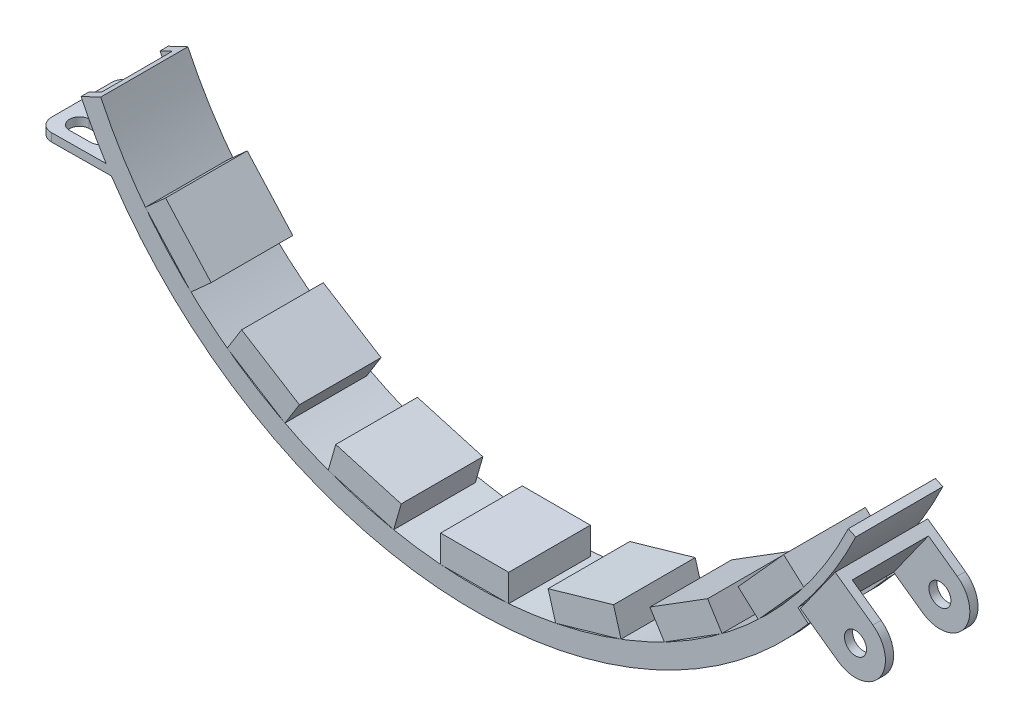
ISO-10303-21;
HEADER;
FILE_DESCRIPTION(('STEP AP214'),'2;1');
FILE_NAME('part.step','',(''),(''),'','','');
FILE_SCHEMA(('AUTOMOTIVE_DESIGN { 1 0 10303 214 1 1 1 1 }'));
ENDSEC;
DATA;
#1=APPLICATION_CONTEXT('core data for automotive mechanical design processes');
#2=APPLICATION_PROTOCOL_DEFINITION('international standard','automotive_design',2000,#1);
#3=PRODUCT_CONTEXT('',#1,'mechanical');
#4=PRODUCT('Part','Part','',(#3));
#5=PRODUCT_RELATED_PRODUCT_CATEGORY('part','',(#4));
#6=PRODUCT_DEFINITION_FORMATION('','',#4);
#7=PRODUCT_DEFINITION_CONTEXT('part definition',#1,'design');
#8=PRODUCT_DEFINITION('design','',#6,#7);
#9=PRODUCT_DEFINITION_SHAPE('','',#8);
#10=(LENGTH_UNIT() NAMED_UNIT(*) SI_UNIT(.MILLI.,.METRE.));
#11=(NAMED_UNIT(*) PLANE_ANGLE_UNIT() SI_UNIT($,.RADIAN.));
#12=(NAMED_UNIT(*) SI_UNIT($,.STERADIAN.) SOLID_ANGLE_UNIT());
#13=UNCERTAINTY_MEASURE_WITH_UNIT(LENGTH_MEASURE(1.E-05),#10,'distance_accuracy_value','');
#14=(GEOMETRIC_REPRESENTATION_CONTEXT(3) GLOBAL_UNCERTAINTY_ASSIGNED_CONTEXT((#13)) GLOBAL_UNIT_ASSIGNED_CONTEXT((#10,
#11,#12)) REPRESENTATION_CONTEXT('',''));
#15=CARTESIAN_POINT('',(0.,0.,0.));
#16=DIRECTION('',(0.,0.,1.));
#17=DIRECTION('',(1.,0.,0.));
#18=AXIS2_PLACEMENT_3D('',#15,#16,#17);
#19=CARTESIAN_POINT('',(-1024.72203517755,174.320142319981,-14.));
#20=DIRECTION('',(-0.000322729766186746,0.999999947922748,0.));
#21=DIRECTION('',(-0.999999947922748,-0.000322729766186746,0.));
#22=AXIS2_PLACEMENT_3D('',#19,#20,#21);
#23=PLANE('',#22);
#24=DIRECTION('',(-0.999999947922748,-0.000322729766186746,0.));
#25=VECTOR('',#24,1.);
#26=CARTESIAN_POINT('',(-1024.72203517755,174.320142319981,16.));
#27=LINE('',#26,#25);
#28=CARTESIAN_POINT('',(-999.722036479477,174.328210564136,16.));
#29=VERTEX_POINT('',#28);
#30=CARTESIAN_POINT('',(-1024.72203517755,174.320142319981,16.));
#31=VERTEX_POINT('',#30);
#32=EDGE_CURVE('P0_E56',#29,#31,#27,.T.);
#33=ORIENTED_EDGE('',*,*,#32,.F.);
#34=DIRECTION('',(0.,0.,1.));
#35=VECTOR('',#34,1.);
#36=CARTESIAN_POINT('',(-999.722036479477,174.328210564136,-14.));
#37=LINE('',#36,#35);
#38=CARTESIAN_POINT('',(-999.722036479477,174.328210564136,-14.));
#39=VERTEX_POINT('',#38);
#40=EDGE_CURVE('P0_E11',#39,#29,#37,.T.);
#41=ORIENTED_EDGE('',*,*,#40,.F.);
#42=DIRECTION('',(-0.999999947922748,-0.000322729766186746,0.));
#43=VECTOR('',#42,1.);
#44=CARTESIAN_POINT('',(-1024.72203517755,174.320142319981,-14.));
#45=LINE('',#44,#43);
#46=CARTESIAN_POINT('',(-1024.72203517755,174.320142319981,-14.));
#47=VERTEX_POINT('',#46);
#48=EDGE_CURVE('P0_E58',#39,#47,#45,.T.);
#49=ORIENTED_EDGE('',*,*,#48,.T.);
#50=DIRECTION('',(0.,0.,1.));
#51=VECTOR('',#50,1.);
#52=CARTESIAN_POINT('',(-1024.72203517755,174.320142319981,-14.));
#53=LINE('',#52,#51);
#54=EDGE_CURVE('P0_E19',#47,#31,#53,.T.);
#55=ORIENTED_EDGE('',*,*,#54,.T.);
#56=EDGE_LOOP('',(#33,#41,#49,#55));
#57=FACE_BOUND('',#56,.T.);
#58=ADVANCED_FACE('P0_F16',(#57),#23,.T.);
#59=CARTESIAN_POINT('',(-999.718809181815,164.328211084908,-14.));
#60=DIRECTION('',(0.999999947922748,0.000322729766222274,0.));
#61=DIRECTION('',(-0.000322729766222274,0.999999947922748,0.));
#62=AXIS2_PLACEMENT_3D('',#59,#60,#61);
#63=PLANE('',#62);
#64=DIRECTION('',(-0.000322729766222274,0.999999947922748,0.));
#65=VECTOR('',#64,1.);
#66=CARTESIAN_POINT('',(-999.718809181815,164.328211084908,16.));
#67=LINE('',#66,#65);
#68=CARTESIAN_POINT('',(-999.718809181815,164.328211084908,16.));
#69=VERTEX_POINT('',#68);
#70=EDGE_CURVE('P0_E73',#69,#29,#67,.T.);
#71=ORIENTED_EDGE('',*,*,#70,.F.);
#72=DIRECTION('',(0.,0.,1.));
#73=VECTOR('',#72,1.);
#74=CARTESIAN_POINT('',(-999.718809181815,164.328211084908,-14.));
#75=LINE('',#74,#73);
#76=CARTESIAN_POINT('',(-999.718809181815,164.328211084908,-14.));
#77=VERTEX_POINT('',#76);
#78=EDGE_CURVE('P0_E24',#77,#69,#75,.T.);
#79=ORIENTED_EDGE('',*,*,#78,.F.);
#80=DIRECTION('',(-0.000322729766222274,0.999999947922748,0.));
#81=VECTOR('',#80,1.);
#82=CARTESIAN_POINT('',(-999.718809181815,164.328211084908,-14.));
#83=LINE('',#82,#81);
#84=EDGE_CURVE('P0_E63',#77,#39,#83,.T.);
#85=ORIENTED_EDGE('',*,*,#84,.T.);
#86=ORIENTED_EDGE('',*,*,#40,.T.);
#87=EDGE_LOOP('',(#71,#79,#85,#86));
#88=FACE_BOUND('',#87,.T.);
#89=ADVANCED_FACE('P0_F88',(#88),#63,.T.);
#90=CARTESIAN_POINT('',(-1024.71880787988,164.320142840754,-14.));
#91=DIRECTION('',(0.000322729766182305,-0.999999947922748,0.));
#92=DIRECTION('',(0.999999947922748,0.000322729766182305,0.));
#93=AXIS2_PLACEMENT_3D('',#90,#91,#92);
#94=PLANE('',#93);
#95=DIRECTION('',(0.999999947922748,0.000322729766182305,0.));
#96=VECTOR('',#95,1.);
#97=CARTESIAN_POINT('',(-1024.71880787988,164.320142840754,16.));
#98=LINE('',#97,#96);
#99=CARTESIAN_POINT('',(-1024.71880787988,164.320142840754,16.));
#100=VERTEX_POINT('',#99);
#101=EDGE_CURVE('P0_E70',#100,#69,#98,.T.);
#102=ORIENTED_EDGE('',*,*,#101,.F.);
#103=DIRECTION('',(0.,0.,1.));
#104=VECTOR('',#103,1.);
#105=CARTESIAN_POINT('',(-1024.71880787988,164.320142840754,-14.));
#106=LINE('',#105,#104);
#107=CARTESIAN_POINT('',(-1024.71880787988,164.320142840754,-14.));
#108=VERTEX_POINT('',#107);
#109=EDGE_CURVE('P0_E62',#108,#100,#106,.T.);
#110=ORIENTED_EDGE('',*,*,#109,.F.);
#111=DIRECTION('',(0.999999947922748,0.000322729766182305,0.));
#112=VECTOR('',#111,1.);
#113=CARTESIAN_POINT('',(-1024.71880787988,164.320142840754,-14.));
#114=LINE('',#113,#112);
#115=EDGE_CURVE('P0_E81',#108,#77,#114,.T.);
#116=ORIENTED_EDGE('',*,*,#115,.T.);
#117=ORIENTED_EDGE('',*,*,#78,.T.);
#118=EDGE_LOOP('',(#102,#110,#116,#117));
#119=FACE_BOUND('',#118,.T.);
#120=ADVANCED_FACE('P0_F85',(#119),#94,.T.);
#121=CARTESIAN_POINT('',(-1024.72203517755,174.320142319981,-14.));
#122=DIRECTION('',(-0.999999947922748,-0.000322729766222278,0.));
#123=DIRECTION('',(0.000322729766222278,-0.999999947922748,0.));
#124=AXIS2_PLACEMENT_3D('',#121,#122,#123);
#125=PLANE('',#124);
#126=DIRECTION('',(0.000322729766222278,-0.999999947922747,0.));
#127=VECTOR('',#126,1.);
#128=CARTESIAN_POINT('',(-1024.72203517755,174.320142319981,16.));
#129=LINE('',#128,#127);
#130=EDGE_CURVE('P0_E65',#31,#100,#129,.T.);
#131=ORIENTED_EDGE('',*,*,#130,.F.);
#132=ORIENTED_EDGE('',*,*,#54,.F.);
#133=DIRECTION('',(0.000322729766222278,-0.999999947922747,0.));
#134=VECTOR('',#133,1.);
#135=CARTESIAN_POINT('',(-1024.72203517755,174.320142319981,-14.));
#136=LINE('',#135,#134);
#137=EDGE_CURVE('P0_E79',#47,#108,#136,.T.);
#138=ORIENTED_EDGE('',*,*,#137,.T.);
#139=ORIENTED_EDGE('',*,*,#109,.T.);
#140=EDGE_LOOP('',(#131,#132,#138,#139));
#141=FACE_BOUND('',#140,.T.);
#142=ADVANCED_FACE('P0_F66',(#141),#125,.T.);
#143=CARTESIAN_POINT('',(-999.722036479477,174.328210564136,-14.));
#144=DIRECTION('',(0.,0.,1.));
#145=DIRECTION('',(1.,0.,0.));
#146=AXIS2_PLACEMENT_3D('',#143,#144,#145);
#147=PLANE('',#146);
#148=ORIENTED_EDGE('',*,*,#48,.F.);
#149=ORIENTED_EDGE('',*,*,#84,.F.);
#150=ORIENTED_EDGE('',*,*,#115,.F.);
#151=ORIENTED_EDGE('',*,*,#137,.F.);
#152=EDGE_LOOP('',(#148,#149,#150,#151));
#153=FACE_BOUND('',#152,.T.);
#154=ADVANCED_FACE('P0_F90',(#153),#147,.F.);
#155=CARTESIAN_POINT('',(-999.722036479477,174.328210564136,16.));
#156=DIRECTION('',(0.,0.,1.));
#157=DIRECTION('',(1.,0.,0.));
#158=AXIS2_PLACEMENT_3D('',#155,#156,#157);
#159=PLANE('',#158);
#160=ORIENTED_EDGE('',*,*,#32,.T.);
#161=ORIENTED_EDGE('',*,*,#130,.T.);
#162=ORIENTED_EDGE('',*,*,#101,.T.);
#163=ORIENTED_EDGE('',*,*,#70,.T.);
#164=EDGE_LOOP('',(#160,#161,#162,#163));
#165=FACE_BOUND('',#164,.T.);
#166=ADVANCED_FACE('P0_F72',(#165),#159,.T.);
#167=CLOSED_SHELL('',(#58,#89,#120,#142,#154,#166));
#168=MANIFOLD_SOLID_BREP('P0_B1',#167);
#169=CARTESIAN_POINT('',(-985.239873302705,176.36831222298,-14.));
#170=DIRECTION('',(-0.275947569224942,0.961172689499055,0.));
#171=DIRECTION('',(-0.961172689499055,-0.275947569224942,0.));
#172=AXIS2_PLACEMENT_3D('',#169,#170,#171);
#173=PLANE('',#172);
#174=DIRECTION('',(-0.961172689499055,-0.275947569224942,0.));
#175=VECTOR('',#174,1.);
#176=CARTESIAN_POINT('',(-985.239873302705,176.36831222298,16.));
#177=LINE('',#176,#175);
#178=CARTESIAN_POINT('',(-961.210556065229,183.267001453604,16.));
#179=VERTEX_POINT('',#178);
#180=CARTESIAN_POINT('',(-985.239873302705,176.36831222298,16.));
#181=VERTEX_POINT('',#180);
#182=EDGE_CURVE('P1_E56',#179,#181,#177,.T.);
#183=ORIENTED_EDGE('',*,*,#182,.F.);
#184=DIRECTION('',(0.,0.,1.));
#185=VECTOR('',#184,1.);
#186=CARTESIAN_POINT('',(-961.210556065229,183.267001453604,-14.));
#187=LINE('',#186,#185);
#188=CARTESIAN_POINT('',(-961.210556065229,183.267001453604,-14.));
#189=VERTEX_POINT('',#188);
#190=EDGE_CURVE('P1_E11',#189,#179,#187,.T.);
#191=ORIENTED_EDGE('',*,*,#190,.F.);
#192=DIRECTION('',(-0.961172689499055,-0.275947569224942,0.));
#193=VECTOR('',#192,1.);
#194=CARTESIAN_POINT('',(-985.239873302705,176.36831222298,-14.));
#195=LINE('',#194,#193);
#196=CARTESIAN_POINT('',(-985.239873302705,176.36831222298,-14.));
#197=VERTEX_POINT('',#196);
#198=EDGE_CURVE('P1_E58',#189,#197,#195,.T.);
#199=ORIENTED_EDGE('',*,*,#198,.T.);
#200=DIRECTION('',(0.,0.,1.));
#201=VECTOR('',#200,1.);
#202=CARTESIAN_POINT('',(-985.239873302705,176.36831222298,-14.));
#203=LINE('',#202,#201);
#204=EDGE_CURVE('P1_E19',#197,#181,#203,.T.);
#205=ORIENTED_EDGE('',*,*,#204,.T.);
#206=EDGE_LOOP('',(#183,#191,#199,#205));
#207=FACE_BOUND('',#206,.T.);
#208=ADVANCED_FACE('P1_F16',(#207),#173,.T.);
#209=CARTESIAN_POINT('',(-958.451080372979,173.655274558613,-14.));
#210=DIRECTION('',(0.961172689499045,0.275947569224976,0.));
#211=DIRECTION('',(-0.275947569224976,0.961172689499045,0.));
#212=AXIS2_PLACEMENT_3D('',#209,#210,#211);
#213=PLANE('',#212);
#214=DIRECTION('',(-0.275947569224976,0.961172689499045,0.));
#215=VECTOR('',#214,1.);
#216=CARTESIAN_POINT('',(-958.451080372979,173.655274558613,16.));
#217=LINE('',#216,#215);
#218=CARTESIAN_POINT('',(-958.451080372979,173.655274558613,16.));
#219=VERTEX_POINT('',#218);
#220=EDGE_CURVE('P1_E73',#219,#179,#217,.T.);
#221=ORIENTED_EDGE('',*,*,#220,.F.);
#222=DIRECTION('',(0.,0.,1.));
#223=VECTOR('',#222,1.);
#224=CARTESIAN_POINT('',(-958.451080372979,173.655274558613,-14.));
#225=LINE('',#224,#223);
#226=CARTESIAN_POINT('',(-958.451080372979,173.655274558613,-14.));
#227=VERTEX_POINT('',#226);
#228=EDGE_CURVE('P1_E24',#227,#219,#225,.T.);
#229=ORIENTED_EDGE('',*,*,#228,.F.);
#230=DIRECTION('',(-0.275947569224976,0.961172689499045,0.));
#231=VECTOR('',#230,1.);
#232=CARTESIAN_POINT('',(-958.451080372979,173.655274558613,-14.));
#233=LINE('',#232,#231);
#234=EDGE_CURVE('P1_E63',#227,#189,#233,.T.);
#235=ORIENTED_EDGE('',*,*,#234,.T.);
#236=ORIENTED_EDGE('',*,*,#190,.T.);
#237=EDGE_LOOP('',(#221,#229,#235,#236));
#238=FACE_BOUND('',#237,.T.);
#239=ADVANCED_FACE('P1_F88',(#238),#213,.T.);
#240=CARTESIAN_POINT('',(-982.480397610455,166.75658532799,-14.));
#241=DIRECTION('',(0.27594756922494,-0.961172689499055,0.));
#242=DIRECTION('',(0.961172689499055,0.27594756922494,0.));
#243=AXIS2_PLACEMENT_3D('',#240,#241,#242);
#244=PLANE('',#243);
#245=DIRECTION('',(0.961172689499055,0.27594756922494,0.));
#246=VECTOR('',#245,1.);
#247=CARTESIAN_POINT('',(-982.480397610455,166.75658532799,16.));
#248=LINE('',#247,#246);
#249=CARTESIAN_POINT('',(-982.480397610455,166.75658532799,16.));
#250=VERTEX_POINT('',#249);
#251=EDGE_CURVE('P1_E70',#250,#219,#248,.T.);
#252=ORIENTED_EDGE('',*,*,#251,.F.);
#253=DIRECTION('',(0.,0.,1.));
#254=VECTOR('',#253,1.);
#255=CARTESIAN_POINT('',(-982.480397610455,166.75658532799,-14.));
#256=LINE('',#255,#254);
#257=CARTESIAN_POINT('',(-982.480397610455,166.75658532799,-14.));
#258=VERTEX_POINT('',#257);
#259=EDGE_CURVE('P1_E62',#258,#250,#256,.T.);
#260=ORIENTED_EDGE('',*,*,#259,.F.);
#261=DIRECTION('',(0.961172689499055,0.27594756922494,0.));
#262=VECTOR('',#261,1.);
#263=CARTESIAN_POINT('',(-982.480397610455,166.75658532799,-14.));
#264=LINE('',#263,#262);
#265=EDGE_CURVE('P1_E81',#258,#227,#264,.T.);
#266=ORIENTED_EDGE('',*,*,#265,.T.);
#267=ORIENTED_EDGE('',*,*,#228,.T.);
#268=EDGE_LOOP('',(#252,#260,#266,#267));
#269=FACE_BOUND('',#268,.T.);
#270=ADVANCED_FACE('P1_F85',(#269),#244,.T.);
#271=CARTESIAN_POINT('',(-985.239873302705,176.36831222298,-14.));
#272=DIRECTION('',(-0.961172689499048,-0.275947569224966,0.));
#273=DIRECTION('',(0.275947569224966,-0.961172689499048,0.));
#274=AXIS2_PLACEMENT_3D('',#271,#272,#273);
#275=PLANE('',#274);
#276=DIRECTION('',(0.275947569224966,-0.961172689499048,0.));
#277=VECTOR('',#276,1.);
#278=CARTESIAN_POINT('',(-985.239873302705,176.36831222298,16.));
#279=LINE('',#278,#277);
#280=EDGE_CURVE('P1_E65',#181,#250,#279,.T.);
#281=ORIENTED_EDGE('',*,*,#280,.F.);
#282=ORIENTED_EDGE('',*,*,#204,.F.);
#283=DIRECTION('',(0.275947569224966,-0.961172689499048,0.));
#284=VECTOR('',#283,1.);
#285=CARTESIAN_POINT('',(-985.239873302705,176.36831222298,-14.));
#286=LINE('',#285,#284);
#287=EDGE_CURVE('P1_E79',#197,#258,#286,.T.);
#288=ORIENTED_EDGE('',*,*,#287,.T.);
#289=ORIENTED_EDGE('',*,*,#259,.T.);
#290=EDGE_LOOP('',(#281,#282,#288,#289));
#291=FACE_BOUND('',#290,.T.);
#292=ADVANCED_FACE('P1_F66',(#291),#275,.T.);
#293=CARTESIAN_POINT('',(-985.239873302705,176.36831222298,-14.));
#294=DIRECTION('',(0.,0.,-1.));
#295=DIRECTION('',(-1.,0.,0.));
#296=AXIS2_PLACEMENT_3D('',#293,#294,#295);
#297=PLANE('',#296);
#298=ORIENTED_EDGE('',*,*,#198,.F.);
#299=ORIENTED_EDGE('',*,*,#234,.F.);
#300=ORIENTED_EDGE('',*,*,#265,.F.);
#301=ORIENTED_EDGE('',*,*,#287,.F.);
#302=EDGE_LOOP('',(#298,#299,#300,#301));
#303=FACE_BOUND('',#302,.T.);
#304=ADVANCED_FACE('P1_F90',(#303),#297,.T.);
#305=CARTESIAN_POINT('',(-985.239873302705,176.36831222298,16.));
#306=DIRECTION('',(0.,0.,-1.));
#307=DIRECTION('',(-1.,0.,0.));
#308=AXIS2_PLACEMENT_3D('',#305,#306,#307);
#309=PLANE('',#308);
#310=ORIENTED_EDGE('',*,*,#182,.T.);
#311=ORIENTED_EDGE('',*,*,#280,.T.);
#312=ORIENTED_EDGE('',*,*,#251,.T.);
#313=ORIENTED_EDGE('',*,*,#220,.T.);
#314=EDGE_LOOP('',(#310,#311,#312,#313));
#315=FACE_BOUND('',#314,.T.);
#316=ADVANCED_FACE('P1_F72',(#315),#309,.F.);
#317=CLOSED_SHELL('',(#208,#239,#270,#292,#304,#316));
#318=MANIFOLD_SOLID_BREP('P1_B1',#317);
#319=CARTESIAN_POINT('',(-947.851735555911,189.219898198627,-14.));
#320=DIRECTION('',(-0.530192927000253,0.847877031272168,0.));
#321=DIRECTION('',(-0.847877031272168,-0.530192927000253,0.));
#322=AXIS2_PLACEMENT_3D('',#319,#320,#321);
#323=PLANE('',#322);
#324=DIRECTION('',(-0.847877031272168,-0.530192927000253,0.));
#325=VECTOR('',#324,1.);
#326=CARTESIAN_POINT('',(-947.851735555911,189.219898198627,16.));
#327=LINE('',#326,#325);
#328=CARTESIAN_POINT('',(-926.654809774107,202.474721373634,16.));
#329=VERTEX_POINT('',#328);
#330=CARTESIAN_POINT('',(-947.851735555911,189.219898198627,16.));
#331=VERTEX_POINT('',#330);
#332=EDGE_CURVE('P2_E56',#329,#331,#327,.T.);
#333=ORIENTED_EDGE('',*,*,#332,.F.);
#334=DIRECTION('',(0.,0.,1.));
#335=VECTOR('',#334,1.);
#336=CARTESIAN_POINT('',(-926.654809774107,202.474721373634,-14.));
#337=LINE('',#336,#335);
#338=CARTESIAN_POINT('',(-926.654809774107,202.474721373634,-14.));
#339=VERTEX_POINT('',#338);
#340=EDGE_CURVE('P2_E11',#339,#329,#337,.T.);
#341=ORIENTED_EDGE('',*,*,#340,.F.);
#342=DIRECTION('',(-0.847877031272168,-0.530192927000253,0.));
#343=VECTOR('',#342,1.);
#344=CARTESIAN_POINT('',(-947.851735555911,189.219898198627,-14.));
#345=LINE('',#344,#343);
#346=CARTESIAN_POINT('',(-947.851735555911,189.219898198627,-14.));
#347=VERTEX_POINT('',#346);
#348=EDGE_CURVE('P2_E58',#339,#347,#345,.T.);
#349=ORIENTED_EDGE('',*,*,#348,.T.);
#350=DIRECTION('',(0.,0.,1.));
#351=VECTOR('',#350,1.);
#352=CARTESIAN_POINT('',(-947.851735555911,189.219898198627,-14.));
#353=LINE('',#352,#351);
#354=EDGE_CURVE('P2_E19',#347,#331,#353,.T.);
#355=ORIENTED_EDGE('',*,*,#354,.T.);
#356=EDGE_LOOP('',(#333,#341,#349,#355));
#357=FACE_BOUND('',#356,.T.);
#358=ADVANCED_FACE('P2_F16',(#357),#323,.T.);
#359=CARTESIAN_POINT('',(-921.352880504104,193.995951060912,-14.));
#360=DIRECTION('',(0.84787703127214,0.530192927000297,0.));
#361=DIRECTION('',(-0.530192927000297,0.84787703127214,0.));
#362=AXIS2_PLACEMENT_3D('',#359,#360,#361);
#363=PLANE('',#362);
#364=DIRECTION('',(-0.530192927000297,0.84787703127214,0.));
#365=VECTOR('',#364,1.);
#366=CARTESIAN_POINT('',(-921.352880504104,193.995951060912,16.));
#367=LINE('',#366,#365);
#368=CARTESIAN_POINT('',(-921.352880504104,193.995951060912,16.));
#369=VERTEX_POINT('',#368);
#370=EDGE_CURVE('P2_E73',#369,#329,#367,.T.);
#371=ORIENTED_EDGE('',*,*,#370,.F.);
#372=DIRECTION('',(0.,0.,1.));
#373=VECTOR('',#372,1.);
#374=CARTESIAN_POINT('',(-921.352880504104,193.995951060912,-14.));
#375=LINE('',#374,#373);
#376=CARTESIAN_POINT('',(-921.352880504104,193.995951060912,-14.));
#377=VERTEX_POINT('',#376);
#378=EDGE_CURVE('P2_E24',#377,#369,#375,.T.);
#379=ORIENTED_EDGE('',*,*,#378,.F.);
#380=DIRECTION('',(-0.530192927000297,0.84787703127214,0.));
#381=VECTOR('',#380,1.);
#382=CARTESIAN_POINT('',(-921.352880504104,193.995951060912,-14.));
#383=LINE('',#382,#381);
#384=EDGE_CURVE('P2_E63',#377,#339,#383,.T.);
#385=ORIENTED_EDGE('',*,*,#384,.T.);
#386=ORIENTED_EDGE('',*,*,#340,.T.);
#387=EDGE_LOOP('',(#371,#379,#385,#386));
#388=FACE_BOUND('',#387,.T.);
#389=ADVANCED_FACE('P2_F88',(#388),#363,.T.);
#390=CARTESIAN_POINT('',(-942.549806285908,180.741127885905,-14.));
#391=DIRECTION('',(0.530192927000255,-0.847877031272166,0.));
#392=DIRECTION('',(0.847877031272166,0.530192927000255,0.));
#393=AXIS2_PLACEMENT_3D('',#390,#391,#392);
#394=PLANE('',#393);
#395=DIRECTION('',(0.847877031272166,0.530192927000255,0.));
#396=VECTOR('',#395,1.);
#397=CARTESIAN_POINT('',(-942.549806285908,180.741127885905,16.));
#398=LINE('',#397,#396);
#399=CARTESIAN_POINT('',(-942.549806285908,180.741127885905,16.));
#400=VERTEX_POINT('',#399);
#401=EDGE_CURVE('P2_E70',#400,#369,#398,.T.);
#402=ORIENTED_EDGE('',*,*,#401,.F.);
#403=DIRECTION('',(0.,0.,1.));
#404=VECTOR('',#403,1.);
#405=CARTESIAN_POINT('',(-942.549806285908,180.741127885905,-14.));
#406=LINE('',#405,#404);
#407=CARTESIAN_POINT('',(-942.549806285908,180.741127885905,-14.));
#408=VERTEX_POINT('',#407);
#409=EDGE_CURVE('P2_E62',#408,#400,#406,.T.);
#410=ORIENTED_EDGE('',*,*,#409,.F.);
#411=DIRECTION('',(0.847877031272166,0.530192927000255,0.));
#412=VECTOR('',#411,1.);
#413=CARTESIAN_POINT('',(-942.549806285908,180.741127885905,-14.));
#414=LINE('',#413,#412);
#415=EDGE_CURVE('P2_E81',#408,#377,#414,.T.);
#416=ORIENTED_EDGE('',*,*,#415,.T.);
#417=ORIENTED_EDGE('',*,*,#378,.T.);
#418=EDGE_LOOP('',(#402,#410,#416,#417));
#419=FACE_BOUND('',#418,.T.);
#420=ADVANCED_FACE('P2_F85',(#419),#394,.T.);
#421=CARTESIAN_POINT('',(-947.851735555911,189.219898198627,-14.));
#422=DIRECTION('',(-0.847877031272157,-0.530192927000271,0.));
#423=DIRECTION('',(0.530192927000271,-0.847877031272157,0.));
#424=AXIS2_PLACEMENT_3D('',#421,#422,#423);
#425=PLANE('',#424);
#426=DIRECTION('',(0.530192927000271,-0.847877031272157,0.));
#427=VECTOR('',#426,1.);
#428=CARTESIAN_POINT('',(-947.851735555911,189.219898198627,16.));
#429=LINE('',#428,#427);
#430=EDGE_CURVE('P2_E65',#331,#400,#429,.T.);
#431=ORIENTED_EDGE('',*,*,#430,.F.);
#432=ORIENTED_EDGE('',*,*,#354,.F.);
#433=DIRECTION('',(0.530192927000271,-0.847877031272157,0.));
#434=VECTOR('',#433,1.);
#435=CARTESIAN_POINT('',(-947.851735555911,189.219898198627,-14.));
#436=LINE('',#435,#434);
#437=EDGE_CURVE('P2_E79',#347,#408,#436,.T.);
#438=ORIENTED_EDGE('',*,*,#437,.T.);
#439=ORIENTED_EDGE('',*,*,#409,.T.);
#440=EDGE_LOOP('',(#431,#432,#438,#439));
#441=FACE_BOUND('',#440,.T.);
#442=ADVANCED_FACE('P2_F66',(#441),#425,.T.);
#443=CARTESIAN_POINT('',(-947.851735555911,189.219898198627,-14.));
#444=DIRECTION('',(0.,0.,-1.));
#445=DIRECTION('',(-1.,0.,0.));
#446=AXIS2_PLACEMENT_3D('',#443,#444,#445);
#447=PLANE('',#446);
#448=ORIENTED_EDGE('',*,*,#348,.F.);
#449=ORIENTED_EDGE('',*,*,#384,.F.);
#450=ORIENTED_EDGE('',*,*,#415,.F.);
#451=ORIENTED_EDGE('',*,*,#437,.F.);
#452=EDGE_LOOP('',(#448,#449,#450,#451));
#453=FACE_BOUND('',#452,.T.);
#454=ADVANCED_FACE('P2_F90',(#453),#447,.T.);
#455=CARTESIAN_POINT('',(-947.851735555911,189.219898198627,16.));
#456=DIRECTION('',(0.,0.,-1.));
#457=DIRECTION('',(-1.,0.,0.));
#458=AXIS2_PLACEMENT_3D('',#455,#456,#457);
#459=PLANE('',#458);
#460=ORIENTED_EDGE('',*,*,#332,.T.);
#461=ORIENTED_EDGE('',*,*,#430,.T.);
#462=ORIENTED_EDGE('',*,*,#401,.T.);
#463=ORIENTED_EDGE('',*,*,#370,.T.);
#464=EDGE_LOOP('',(#460,#461,#462,#463));
#465=FACE_BOUND('',#464,.T.);
#466=ADVANCED_FACE('P2_F72',(#465),#459,.F.);
#467=CLOSED_SHELL('',(#358,#389,#420,#442,#454,#466));
#468=MANIFOLD_SOLID_BREP('P2_B1',#467);
#469=CARTESIAN_POINT('',(-915.454328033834,211.879202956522,-14.));
#470=DIRECTION('',(-0.743360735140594,0.668890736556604,0.));
#471=DIRECTION('',(-0.668890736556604,-0.743360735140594,0.));
#472=AXIS2_PLACEMENT_3D('',#469,#470,#471);
#473=PLANE('',#472);
#474=DIRECTION('',(-0.668890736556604,-0.743360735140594,0.));
#475=VECTOR('',#474,1.);
#476=CARTESIAN_POINT('',(-915.454328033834,211.879202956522,16.));
#477=LINE('',#476,#475);
#478=CARTESIAN_POINT('',(-898.732059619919,230.463221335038,16.));
#479=VERTEX_POINT('',#478);
#480=CARTESIAN_POINT('',(-915.454328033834,211.879202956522,16.));
#481=VERTEX_POINT('',#480);
#482=EDGE_CURVE('P3_E56',#479,#481,#477,.T.);
#483=ORIENTED_EDGE('',*,*,#482,.F.);
#484=DIRECTION('',(0.,0.,1.));
#485=VECTOR('',#484,1.);
#486=CARTESIAN_POINT('',(-898.732059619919,230.463221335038,-14.));
#487=LINE('',#486,#485);
#488=CARTESIAN_POINT('',(-898.732059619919,230.463221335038,-14.));
#489=VERTEX_POINT('',#488);
#490=EDGE_CURVE('P3_E11',#489,#479,#487,.T.);
#491=ORIENTED_EDGE('',*,*,#490,.F.);
#492=DIRECTION('',(-0.668890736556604,-0.743360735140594,0.));
#493=VECTOR('',#492,1.);
#494=CARTESIAN_POINT('',(-915.454328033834,211.879202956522,-14.));
#495=LINE('',#494,#493);
#496=CARTESIAN_POINT('',(-915.454328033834,211.879202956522,-14.));
#497=VERTEX_POINT('',#496);
#498=EDGE_CURVE('P3_E58',#489,#497,#495,.T.);
#499=ORIENTED_EDGE('',*,*,#498,.T.);
#500=DIRECTION('',(0.,0.,1.));
#501=VECTOR('',#500,1.);
#502=CARTESIAN_POINT('',(-915.454328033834,211.879202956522,-14.));
#503=LINE('',#502,#501);
#504=EDGE_CURVE('P3_E19',#497,#481,#503,.T.);
#505=ORIENTED_EDGE('',*,*,#504,.T.);
#506=EDGE_LOOP('',(#483,#491,#499,#505));
#507=FACE_BOUND('',#506,.T.);
#508=ADVANCED_FACE('P3_F16',(#507),#473,.T.);
#509=CARTESIAN_POINT('',(-891.298452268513,223.774313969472,-14.));
#510=DIRECTION('',(0.668890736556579,0.743360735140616,0.));
#511=DIRECTION('',(-0.743360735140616,0.668890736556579,0.));
#512=AXIS2_PLACEMENT_3D('',#509,#510,#511);
#513=PLANE('',#512);
#514=DIRECTION('',(-0.743360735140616,0.668890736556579,0.));
#515=VECTOR('',#514,1.);
#516=CARTESIAN_POINT('',(-891.298452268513,223.774313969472,16.));
#517=LINE('',#516,#515);
#518=CARTESIAN_POINT('',(-891.298452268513,223.774313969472,16.));
#519=VERTEX_POINT('',#518);
#520=EDGE_CURVE('P3_E73',#519,#479,#517,.T.);
#521=ORIENTED_EDGE('',*,*,#520,.F.);
#522=DIRECTION('',(0.,0.,1.));
#523=VECTOR('',#522,1.);
#524=CARTESIAN_POINT('',(-891.298452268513,223.774313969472,-14.));
#525=LINE('',#524,#523);
#526=CARTESIAN_POINT('',(-891.298452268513,223.774313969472,-14.));
#527=VERTEX_POINT('',#526);
#528=EDGE_CURVE('P3_E24',#527,#519,#525,.T.);
#529=ORIENTED_EDGE('',*,*,#528,.F.);
#530=DIRECTION('',(-0.743360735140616,0.668890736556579,0.));
#531=VECTOR('',#530,1.);
#532=CARTESIAN_POINT('',(-891.298452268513,223.774313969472,-14.));
#533=LINE('',#532,#531);
#534=EDGE_CURVE('P3_E63',#527,#489,#533,.T.);
#535=ORIENTED_EDGE('',*,*,#534,.T.);
#536=ORIENTED_EDGE('',*,*,#490,.T.);
#537=EDGE_LOOP('',(#521,#529,#535,#536));
#538=FACE_BOUND('',#537,.T.);
#539=ADVANCED_FACE('P3_F88',(#538),#513,.T.);
#540=CARTESIAN_POINT('',(-908.020720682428,205.190295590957,-14.));
#541=DIRECTION('',(0.743360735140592,-0.668890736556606,0.));
#542=DIRECTION('',(0.668890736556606,0.743360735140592,0.));
#543=AXIS2_PLACEMENT_3D('',#540,#541,#542);
#544=PLANE('',#543);
#545=DIRECTION('',(0.668890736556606,0.743360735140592,0.));
#546=VECTOR('',#545,1.);
#547=CARTESIAN_POINT('',(-908.020720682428,205.190295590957,16.));
#548=LINE('',#547,#546);
#549=CARTESIAN_POINT('',(-908.020720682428,205.190295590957,16.));
#550=VERTEX_POINT('',#549);
#551=EDGE_CURVE('P3_E70',#550,#519,#548,.T.);
#552=ORIENTED_EDGE('',*,*,#551,.F.);
#553=DIRECTION('',(0.,0.,1.));
#554=VECTOR('',#553,1.);
#555=CARTESIAN_POINT('',(-908.020720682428,205.190295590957,-14.));
#556=LINE('',#555,#554);
#557=CARTESIAN_POINT('',(-908.020720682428,205.190295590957,-14.));
#558=VERTEX_POINT('',#557);
#559=EDGE_CURVE('P3_E62',#558,#550,#556,.T.);
#560=ORIENTED_EDGE('',*,*,#559,.F.);
#561=DIRECTION('',(0.668890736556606,0.743360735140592,0.));
#562=VECTOR('',#561,1.);
#563=CARTESIAN_POINT('',(-908.020720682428,205.190295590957,-14.));
#564=LINE('',#563,#562);
#565=EDGE_CURVE('P3_E81',#558,#527,#564,.T.);
#566=ORIENTED_EDGE('',*,*,#565,.T.);
#567=ORIENTED_EDGE('',*,*,#528,.T.);
#568=EDGE_LOOP('',(#552,#560,#566,#567));
#569=FACE_BOUND('',#568,.T.);
#570=ADVANCED_FACE('P3_F85',(#569),#544,.T.);
#571=CARTESIAN_POINT('',(-915.454328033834,211.879202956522,-14.));
#572=DIRECTION('',(-0.668890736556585,-0.743360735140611,0.));
#573=DIRECTION('',(0.743360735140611,-0.668890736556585,0.));
#574=AXIS2_PLACEMENT_3D('',#571,#572,#573);
#575=PLANE('',#574);
#576=DIRECTION('',(0.743360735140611,-0.668890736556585,0.));
#577=VECTOR('',#576,1.);
#578=CARTESIAN_POINT('',(-915.454328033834,211.879202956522,16.));
#579=LINE('',#578,#577);
#580=EDGE_CURVE('P3_E65',#481,#550,#579,.T.);
#581=ORIENTED_EDGE('',*,*,#580,.F.);
#582=ORIENTED_EDGE('',*,*,#504,.F.);
#583=DIRECTION('',(0.743360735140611,-0.668890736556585,0.));
#584=VECTOR('',#583,1.);
#585=CARTESIAN_POINT('',(-915.454328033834,211.879202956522,-14.));
#586=LINE('',#585,#584);
#587=EDGE_CURVE('P3_E79',#497,#558,#586,.T.);
#588=ORIENTED_EDGE('',*,*,#587,.T.);
#589=ORIENTED_EDGE('',*,*,#559,.T.);
#590=EDGE_LOOP('',(#581,#582,#588,#589));
#591=FACE_BOUND('',#590,.T.);
#592=ADVANCED_FACE('P3_F66',(#591),#575,.T.);
#593=CARTESIAN_POINT('',(-915.454328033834,211.879202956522,-14.));
#594=DIRECTION('',(0.,0.,-1.));
#595=DIRECTION('',(-1.,0.,0.));
#596=AXIS2_PLACEMENT_3D('',#593,#594,#595);
#597=PLANE('',#596);
#598=ORIENTED_EDGE('',*,*,#498,.F.);
#599=ORIENTED_EDGE('',*,*,#534,.F.);
#600=ORIENTED_EDGE('',*,*,#565,.F.);
#601=ORIENTED_EDGE('',*,*,#587,.F.);
#602=EDGE_LOOP('',(#598,#599,#600,#601));
#603=FACE_BOUND('',#602,.T.);
#604=ADVANCED_FACE('P3_F90',(#603),#597,.T.);
#605=CARTESIAN_POINT('',(-915.454328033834,211.879202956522,16.));
#606=DIRECTION('',(0.,0.,-1.));
#607=DIRECTION('',(-1.,0.,0.));
#608=AXIS2_PLACEMENT_3D('',#605,#606,#607);
#609=PLANE('',#608);
#610=ORIENTED_EDGE('',*,*,#482,.T.);
#611=ORIENTED_EDGE('',*,*,#580,.T.);
#612=ORIENTED_EDGE('',*,*,#551,.T.);
#613=ORIENTED_EDGE('',*,*,#520,.T.);
#614=EDGE_LOOP('',(#610,#611,#612,#613));
#615=FACE_BOUND('',#614,.T.);
#616=ADVANCED_FACE('P3_F72',(#615),#609,.F.);
#617=CLOSED_SHELL('',(#508,#539,#570,#592,#604,#616));
#618=MANIFOLD_SOLID_BREP('P3_B1',#617);
#619=CARTESIAN_POINT('',(-871.342650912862,216.48594958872,17.));
#620=DIRECTION('',(0.,0.,-1.));
#621=DIRECTION('',(-1.,0.,0.));
#622=AXIS2_PLACEMENT_3D('',#619,#620,#621);
#623=CYLINDRICAL_SURFACE('',#622,10.9999999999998);
#624=CARTESIAN_POINT('',(-871.342650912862,216.48594958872,-14.));
#625=DIRECTION('',(0.,0.,1.));
#626=DIRECTION('',(1.,0.,0.));
#627=AXIS2_PLACEMENT_3D('',#624,#625,#626);
#628=CIRCLE('',#627,10.9999999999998);
#629=CARTESIAN_POINT('',(-877.728886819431,207.529611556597,-14.));
#630=VERTEX_POINT('',#629);
#631=CARTESIAN_POINT('',(-864.956415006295,225.442287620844,-14.));
#632=VERTEX_POINT('',#631);
#633=EDGE_CURVE('P4_E164',#630,#632,#628,.T.);
#634=ORIENTED_EDGE('',*,*,#633,.F.);
#635=DIRECTION('',(0.,0.,-1.));
#636=VECTOR('',#635,1.);
#637=CARTESIAN_POINT('',(-877.728886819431,207.529611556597,17.));
#638=LINE('',#637,#636);
#639=CARTESIAN_POINT('',(-877.728886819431,207.529611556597,-17.));
#640=VERTEX_POINT('',#639);
#641=EDGE_CURVE('P4_E118',#630,#640,#638,.T.);
#642=ORIENTED_EDGE('',*,*,#641,.T.);
#643=CARTESIAN_POINT('',(-871.342650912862,216.48594958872,-17.));
#644=DIRECTION('',(0.,0.,1.));
#645=DIRECTION('',(1.,0.,0.));
#646=AXIS2_PLACEMENT_3D('',#643,#644,#645);
#647=CIRCLE('',#646,10.9999999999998);
#648=CARTESIAN_POINT('',(-864.956415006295,225.442287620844,-17.));
#649=VERTEX_POINT('',#648);
#650=EDGE_CURVE('P4_E145',#640,#649,#647,.T.);
#651=ORIENTED_EDGE('',*,*,#650,.T.);
#652=DIRECTION('',(0.,0.,-1.));
#653=VECTOR('',#652,1.);
#654=CARTESIAN_POINT('',(-864.956415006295,225.442287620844,17.));
#655=LINE('',#654,#653);
#656=EDGE_CURVE('P4_E25',#632,#649,#655,.T.);
#657=ORIENTED_EDGE('',*,*,#656,.F.);
#658=EDGE_LOOP('',(#634,#642,#651,#657));
#659=FACE_BOUND('',#658,.T.);
#660=ADVANCED_FACE('P4_F16',(#659),#623,.T.);
#661=CARTESIAN_POINT('',(-864.956415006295,225.442287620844,17.));
#662=DIRECTION('',(-0.580566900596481,-0.814212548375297,0.));
#663=DIRECTION('',(0.814212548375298,-0.580566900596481,0.));
#664=AXIS2_PLACEMENT_3D('',#661,#662,#663);
#665=PLANE('',#664);
#666=DIRECTION('',(-0.814212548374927,0.580566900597,0.));
#667=VECTOR('',#666,1.);
#668=CARTESIAN_POINT('',(-864.956415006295,225.442287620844,-14.));
#669=LINE('',#668,#667);
#670=CARTESIAN_POINT('',(-875.541178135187,232.989657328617,-14.));
#671=VERTEX_POINT('',#670);
#672=EDGE_CURVE('P4_E169',#632,#671,#669,.T.);
#673=ORIENTED_EDGE('',*,*,#672,.F.);
#674=ORIENTED_EDGE('',*,*,#656,.T.);
#675=DIRECTION('',(-0.814212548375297,0.580566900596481,0.));
#676=VECTOR('',#675,1.);
#677=CARTESIAN_POINT('',(-864.956415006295,225.442287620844,-17.));
#678=LINE('',#677,#676);
#679=CARTESIAN_POINT('',(-878.798028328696,235.311924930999,-17.));
#680=VERTEX_POINT('',#679);
#681=EDGE_CURVE('P4_E148',#649,#680,#678,.T.);
#682=ORIENTED_EDGE('',*,*,#681,.T.);
#683=DIRECTION('',(0.,0.,-1.));
#684=VECTOR('',#683,1.);
#685=CARTESIAN_POINT('',(-878.798028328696,235.311924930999,17.));
#686=LINE('',#685,#684);
#687=CARTESIAN_POINT('',(-878.798028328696,235.311924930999,17.));
#688=VERTEX_POINT('',#687);
#689=EDGE_CURVE('P4_E102',#688,#680,#686,.T.);
#690=ORIENTED_EDGE('',*,*,#689,.F.);
#691=DIRECTION('',(-0.814212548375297,0.580566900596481,0.));
#692=VECTOR('',#691,1.);
#693=CARTESIAN_POINT('',(-864.956415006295,225.442287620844,17.));
#694=LINE('',#693,#692);
#695=CARTESIAN_POINT('',(-864.956415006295,225.442287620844,17.));
#696=VERTEX_POINT('',#695);
#697=EDGE_CURVE('P4_E100',#696,#688,#694,.T.);
#698=ORIENTED_EDGE('',*,*,#697,.F.);
#699=CARTESIAN_POINT('',(-864.956415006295,225.442287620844,14.));
#700=VERTEX_POINT('',#699);
#701=EDGE_CURVE('P4_E11',#696,#700,#655,.T.);
#702=ORIENTED_EDGE('',*,*,#701,.T.);
#703=DIRECTION('',(-0.814212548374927,0.580566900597,0.));
#704=VECTOR('',#703,1.);
#705=CARTESIAN_POINT('',(-864.956415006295,225.442287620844,14.));
#706=LINE('',#705,#704);
#707=CARTESIAN_POINT('',(-875.541178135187,232.989657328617,14.));
#708=VERTEX_POINT('',#707);
#709=EDGE_CURVE('P4_E83',#700,#708,#706,.T.);
#710=ORIENTED_EDGE('',*,*,#709,.T.);
#711=DIRECTION('',(0.,0.,1.));
#712=VECTOR('',#711,1.);
#713=CARTESIAN_POINT('',(-875.541178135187,232.989657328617,-14.));
#714=LINE('',#713,#712);
#715=EDGE_CURVE('P4_E131',#671,#708,#714,.T.);
#716=ORIENTED_EDGE('',*,*,#715,.F.);
#717=EDGE_LOOP('',(#673,#674,#682,#690,#698,#702,#710,#716));
#718=FACE_BOUND('',#717,.T.);
#719=ADVANCED_FACE('P4_F98',(#718),#665,.F.);
#720=CARTESIAN_POINT('',(-877.728886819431,207.529611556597,17.));
#721=DIRECTION('',(0.580566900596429,0.814212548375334,0.));
#722=DIRECTION('',(-0.814212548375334,0.580566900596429,0.));
#723=AXIS2_PLACEMENT_3D('',#720,#721,#722);
#724=PLANE('',#723);
#725=DIRECTION('',(0.814212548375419,-0.58056690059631,0.));
#726=VECTOR('',#725,1.);
#727=CARTESIAN_POINT('',(-888.313649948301,215.076981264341,-14.));
#728=LINE('',#727,#726);
#729=CARTESIAN_POINT('',(-888.313649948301,215.076981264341,-14.));
#730=VERTEX_POINT('',#729);
#731=EDGE_CURVE('P4_E165',#730,#630,#728,.T.);
#732=ORIENTED_EDGE('',*,*,#731,.F.);
#733=DIRECTION('',(0.,0.,1.));
#734=VECTOR('',#733,1.);
#735=CARTESIAN_POINT('',(-888.313649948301,215.076981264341,-14.));
#736=LINE('',#735,#734);
#737=CARTESIAN_POINT('',(-888.313649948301,215.076981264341,14.));
#738=VERTEX_POINT('',#737);
#739=EDGE_CURVE('P4_E125',#730,#738,#736,.T.);
#740=ORIENTED_EDGE('',*,*,#739,.T.);
#741=DIRECTION('',(0.814212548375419,-0.58056690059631,0.));
#742=VECTOR('',#741,1.);
#743=CARTESIAN_POINT('',(-888.313649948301,215.076981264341,14.));
#744=LINE('',#743,#742);
#745=CARTESIAN_POINT('',(-877.728886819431,207.529611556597,14.));
#746=VERTEX_POINT('',#745);
#747=EDGE_CURVE('P4_E95',#738,#746,#744,.T.);
#748=ORIENTED_EDGE('',*,*,#747,.T.);
#749=CARTESIAN_POINT('',(-877.728886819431,207.529611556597,17.));
#750=VERTEX_POINT('',#749);
#751=EDGE_CURVE('P4_E94',#750,#746,#638,.T.);
#752=ORIENTED_EDGE('',*,*,#751,.F.);
#753=DIRECTION('',(0.814212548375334,-0.580566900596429,0.));
#754=VECTOR('',#753,1.);
#755=CARTESIAN_POINT('',(-877.728886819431,207.529611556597,17.));
#756=LINE('',#755,#754);
#757=CARTESIAN_POINT('',(-891.570500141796,217.399248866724,17.));
#758=VERTEX_POINT('',#757);
#759=EDGE_CURVE('P4_E41',#758,#750,#756,.T.);
#760=ORIENTED_EDGE('',*,*,#759,.F.);
#761=DIRECTION('',(0.,0.,-1.));
#762=VECTOR('',#761,1.);
#763=CARTESIAN_POINT('',(-891.570500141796,217.399248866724,17.));
#764=LINE('',#763,#762);
#765=CARTESIAN_POINT('',(-891.570500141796,217.399248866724,-17.));
#766=VERTEX_POINT('',#765);
#767=EDGE_CURVE('P4_E120',#758,#766,#764,.T.);
#768=ORIENTED_EDGE('',*,*,#767,.T.);
#769=DIRECTION('',(0.814212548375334,-0.580566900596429,0.));
#770=VECTOR('',#769,1.);
#771=CARTESIAN_POINT('',(-877.728886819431,207.529611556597,-17.));
#772=LINE('',#771,#770);
#773=EDGE_CURVE('P4_E109',#766,#640,#772,.T.);
#774=ORIENTED_EDGE('',*,*,#773,.T.);
#775=ORIENTED_EDGE('',*,*,#641,.F.);
#776=EDGE_LOOP('',(#732,#740,#748,#752,#760,#768,#774,#775));
#777=FACE_BOUND('',#776,.T.);
#778=ADVANCED_FACE('P4_F156',(#777),#724,.F.);
#779=CARTESIAN_POINT('',(-871.342650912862,216.48594958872,17.));
#780=DIRECTION('',(0.,0.,-1.));
#781=DIRECTION('',(-1.,0.,0.));
#782=AXIS2_PLACEMENT_3D('',#779,#780,#781);
#783=CYLINDRICAL_SURFACE('',#782,4.05);
#784=CARTESIAN_POINT('',(-871.342650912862,216.48594958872,-17.));
#785=DIRECTION('',(0.,0.,1.));
#786=DIRECTION('',(1.,0.,0.));
#787=AXIS2_PLACEMENT_3D('',#784,#785,#786);
#788=CIRCLE('',#787,4.05);
#789=CARTESIAN_POINT('',(-867.292650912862,216.48594958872,-17.));
#790=VERTEX_POINT('',#789);
#791=EDGE_CURVE('P4_E129',#790,#790,#788,.T.);
#792=ORIENTED_EDGE('',*,*,#791,.F.);
#793=EDGE_LOOP('',(#792));
#794=FACE_BOUND('',#793,.T.);
#795=CARTESIAN_POINT('',(-871.342650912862,216.48594958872,-14.));
#796=DIRECTION('',(0.,0.,1.));
#797=DIRECTION('',(1.,0.,0.));
#798=AXIS2_PLACEMENT_3D('',#795,#796,#797);
#799=CIRCLE('',#798,4.05);
#800=CARTESIAN_POINT('',(-867.292650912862,216.48594958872,-14.));
#801=VERTEX_POINT('',#800);
#802=EDGE_CURVE('P4_E20',#801,#801,#799,.T.);
#803=ORIENTED_EDGE('',*,*,#802,.T.);
#804=EDGE_LOOP('',(#803));
#805=FACE_BOUND('',#804,.T.);
#806=ADVANCED_FACE('P4_F189',(#794,#805),#783,.F.);
#807=CARTESIAN_POINT('',(-871.342650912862,216.48594958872,17.));
#808=DIRECTION('',(0.,0.,1.));
#809=DIRECTION('',(1.,0.,0.));
#810=AXIS2_PLACEMENT_3D('',#807,#808,#809);
#811=PLANE('',#810);
#812=CARTESIAN_POINT('',(-871.342650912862,216.48594958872,17.));
#813=DIRECTION('',(0.,0.,1.));
#814=DIRECTION('',(1.,0.,0.));
#815=AXIS2_PLACEMENT_3D('',#812,#813,#814);
#816=CIRCLE('',#815,10.9999999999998);
#817=EDGE_CURVE('P4_E105',#750,#696,#816,.T.);
#818=ORIENTED_EDGE('',*,*,#817,.T.);
#819=ORIENTED_EDGE('',*,*,#697,.T.);
#820=DIRECTION('',(-0.580566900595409,-0.814212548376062,0.));
#821=VECTOR('',#820,1.);
#822=CARTESIAN_POINT('',(-891.570500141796,217.399248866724,17.));
#823=LINE('',#822,#821);
#824=EDGE_CURVE('P4_E104',#688,#758,#823,.T.);
#825=ORIENTED_EDGE('',*,*,#824,.T.);
#826=ORIENTED_EDGE('',*,*,#759,.T.);
#827=EDGE_LOOP('',(#818,#819,#825,#826));
#828=FACE_BOUND('',#827,.T.);
#829=CARTESIAN_POINT('',(-871.342650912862,216.48594958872,17.));
#830=DIRECTION('',(0.,0.,1.));
#831=DIRECTION('',(1.,0.,0.));
#832=AXIS2_PLACEMENT_3D('',#829,#830,#831);
#833=CIRCLE('',#832,4.05);
#834=CARTESIAN_POINT('',(-867.292650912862,216.48594958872,17.));
#835=VERTEX_POINT('',#834);
#836=EDGE_CURVE('P4_E142',#835,#835,#833,.T.);
#837=ORIENTED_EDGE('',*,*,#836,.F.);
#838=EDGE_LOOP('',(#837));
#839=FACE_BOUND('',#838,.T.);
#840=ADVANCED_FACE('P4_F107',(#828,#839),#811,.T.);
#841=CARTESIAN_POINT('',(-871.342650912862,216.48594958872,-17.));
#842=DIRECTION('',(0.,0.,1.));
#843=DIRECTION('',(1.,0.,0.));
#844=AXIS2_PLACEMENT_3D('',#841,#842,#843);
#845=PLANE('',#844);
#846=ORIENTED_EDGE('',*,*,#650,.F.);
#847=ORIENTED_EDGE('',*,*,#773,.F.);
#848=DIRECTION('',(-0.580566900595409,-0.814212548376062,0.));
#849=VECTOR('',#848,1.);
#850=CARTESIAN_POINT('',(-891.570500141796,217.399248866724,-17.));
#851=LINE('',#850,#849);
#852=EDGE_CURVE('P4_E112',#680,#766,#851,.T.);
#853=ORIENTED_EDGE('',*,*,#852,.F.);
#854=ORIENTED_EDGE('',*,*,#681,.F.);
#855=EDGE_LOOP('',(#846,#847,#853,#854));
#856=FACE_BOUND('',#855,.T.);
#857=ORIENTED_EDGE('',*,*,#791,.T.);
#858=EDGE_LOOP('',(#857));
#859=FACE_BOUND('',#858,.T.);
#860=ADVANCED_FACE('P4_F159',(#856,#859),#845,.F.);
#861=ORIENTED_EDGE('',*,*,#751,.T.);
#862=CARTESIAN_POINT('',(-871.342650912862,216.48594958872,14.));
#863=DIRECTION('',(0.,0.,1.));
#864=DIRECTION('',(1.,0.,0.));
#865=AXIS2_PLACEMENT_3D('',#862,#863,#864);
#866=CIRCLE('',#865,10.9999999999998);
#867=EDGE_CURVE('P4_E33',#746,#700,#866,.T.);
#868=ORIENTED_EDGE('',*,*,#867,.T.);
#869=ORIENTED_EDGE('',*,*,#701,.F.);
#870=ORIENTED_EDGE('',*,*,#817,.F.);
#871=EDGE_LOOP('',(#861,#868,#869,#870));
#872=FACE_BOUND('',#871,.T.);
#873=ADVANCED_FACE('P4_F18',(#872),#623,.T.);
#874=CARTESIAN_POINT('',(-891.570500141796,217.399248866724,17.));
#875=DIRECTION('',(0.814212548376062,-0.580566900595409,0.));
#876=DIRECTION('',(0.580566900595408,0.814212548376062,0.));
#877=AXIS2_PLACEMENT_3D('',#874,#875,#876);
#878=PLANE('',#877);
#879=ORIENTED_EDGE('',*,*,#852,.T.);
#880=ORIENTED_EDGE('',*,*,#767,.F.);
#881=ORIENTED_EDGE('',*,*,#824,.F.);
#882=ORIENTED_EDGE('',*,*,#689,.T.);
#883=EDGE_LOOP('',(#879,#880,#881,#882));
#884=FACE_BOUND('',#883,.T.);
#885=ADVANCED_FACE('P4_F152',(#884),#878,.F.);
#886=CARTESIAN_POINT('',(-871.342650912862,216.48594958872,14.));
#887=DIRECTION('',(0.,0.,1.));
#888=DIRECTION('',(1.,0.,0.));
#889=AXIS2_PLACEMENT_3D('',#886,#887,#888);
#890=CIRCLE('',#889,4.05);
#891=CARTESIAN_POINT('',(-867.292650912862,216.48594958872,14.));
#892=VERTEX_POINT('',#891);
#893=EDGE_CURVE('P4_E123',#892,#892,#890,.T.);
#894=ORIENTED_EDGE('',*,*,#893,.F.);
#895=EDGE_LOOP('',(#894));
#896=FACE_BOUND('',#895,.T.);
#897=ORIENTED_EDGE('',*,*,#836,.T.);
#898=EDGE_LOOP('',(#897));
#899=FACE_BOUND('',#898,.T.);
#900=ADVANCED_FACE('P4_F177',(#896,#899),#783,.F.);
#901=CARTESIAN_POINT('',(-888.313649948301,215.076981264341,-14.));
#902=DIRECTION('',(-0.814212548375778,0.580566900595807,0.));
#903=DIRECTION('',(-0.580566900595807,-0.814212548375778,0.));
#904=AXIS2_PLACEMENT_3D('',#901,#902,#903);
#905=PLANE('',#904);
#906=DIRECTION('',(-0.580566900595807,-0.814212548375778,0.));
#907=VECTOR('',#906,1.);
#908=CARTESIAN_POINT('',(-888.313649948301,215.076981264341,14.));
#909=LINE('',#908,#907);
#910=EDGE_CURVE('P4_E86',#708,#738,#909,.T.);
#911=ORIENTED_EDGE('',*,*,#910,.T.);
#912=ORIENTED_EDGE('',*,*,#739,.F.);
#913=DIRECTION('',(-0.580566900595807,-0.814212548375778,0.));
#914=VECTOR('',#913,1.);
#915=CARTESIAN_POINT('',(-888.313649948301,215.076981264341,-14.));
#916=LINE('',#915,#914);
#917=EDGE_CURVE('P4_E135',#671,#730,#916,.T.);
#918=ORIENTED_EDGE('',*,*,#917,.F.);
#919=ORIENTED_EDGE('',*,*,#715,.T.);
#920=EDGE_LOOP('',(#911,#912,#918,#919));
#921=FACE_BOUND('',#920,.T.);
#922=ADVANCED_FACE('P4_F175',(#921),#905,.F.);
#923=CARTESIAN_POINT('',(-871.342650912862,216.48594958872,-14.));
#924=DIRECTION('',(0.,0.,1.));
#925=DIRECTION('',(1.,0.,0.));
#926=AXIS2_PLACEMENT_3D('',#923,#924,#925);
#927=PLANE('',#926);
#928=ORIENTED_EDGE('',*,*,#802,.F.);
#929=EDGE_LOOP('',(#928));
#930=FACE_BOUND('',#929,.T.);
#931=ORIENTED_EDGE('',*,*,#731,.T.);
#932=ORIENTED_EDGE('',*,*,#633,.T.);
#933=ORIENTED_EDGE('',*,*,#672,.T.);
#934=ORIENTED_EDGE('',*,*,#917,.T.);
#935=EDGE_LOOP('',(#931,#932,#933,#934));
#936=FACE_BOUND('',#935,.T.);
#937=ADVANCED_FACE('P4_F173',(#930,#936),#927,.T.);
#938=CARTESIAN_POINT('',(-871.342650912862,216.48594958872,14.));
#939=DIRECTION('',(0.,0.,1.));
#940=DIRECTION('',(1.,0.,0.));
#941=AXIS2_PLACEMENT_3D('',#938,#939,#940);
#942=PLANE('',#941);
#943=ORIENTED_EDGE('',*,*,#893,.T.);
#944=EDGE_LOOP('',(#943));
#945=FACE_BOUND('',#944,.T.);
#946=ORIENTED_EDGE('',*,*,#747,.F.);
#947=ORIENTED_EDGE('',*,*,#910,.F.);
#948=ORIENTED_EDGE('',*,*,#709,.F.);
#949=ORIENTED_EDGE('',*,*,#867,.F.);
#950=EDGE_LOOP('',(#946,#947,#948,#949));
#951=FACE_BOUND('',#950,.T.);
#952=ADVANCED_FACE('P4_F84',(#945,#951),#942,.F.);
#953=CLOSED_SHELL('',(#660,#719,#778,#806,#840,#860,#873,#885,#900,#922,#937,#952));
#954=MANIFOLD_SOLID_BREP('P4_B1',#953);
#955=CARTESIAN_POINT('',(-1012.26769729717,315.809316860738,-16.));
#956=DIRECTION('',(0.,0.,1.));
#957=DIRECTION('',(1.,0.,0.));
#958=AXIS2_PLACEMENT_3D('',#955,#956,#957);
#959=PLANE('',#958);
#960=DIRECTION('',(0.999956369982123,0.00934120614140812,0.));
#961=VECTOR('',#960,1.);
#962=CARTESIAN_POINT('',(-1172.57635195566,227.179604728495,-16.));
#963=LINE('',#962,#961);
#964=CARTESIAN_POINT('',(-1164.5767009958,227.254334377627,-15.9999999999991));
#965=VERTEX_POINT('',#964);
#966=CARTESIAN_POINT('',(-1145.64425965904,227.431193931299,-16.));
#967=VERTEX_POINT('',#966);
#968=EDGE_CURVE('P5_E272',#965,#967,#963,.T.);
#969=ORIENTED_EDGE('',*,*,#968,.F.);
#970=DIRECTION('',(0.00934120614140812,-0.999956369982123,0.));
#971=VECTOR('',#970,1.);
#972=CARTESIAN_POINT('',(-1164.87561959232,259.252938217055,-15.9999999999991));
#973=LINE('',#972,#971);
#974=CARTESIAN_POINT('',(-1164.60472461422,230.254203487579,-15.9999999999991));
#975=VERTEX_POINT('',#974);
#976=EDGE_CURVE('P5_E243',#975,#965,#973,.T.);
#977=ORIENTED_EDGE('',*,*,#976,.F.);
#978=DIRECTION('',(-0.999956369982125,-0.00934120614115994,0.));
#979=VECTOR('',#978,1.);
#980=CARTESIAN_POINT('',(-1172.60437557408,230.179473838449,-16.));
#981=LINE('',#980,#979);
#982=CARTESIAN_POINT('',(-1147.57298753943,230.413307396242,-16.));
#983=VERTEX_POINT('',#982);
#984=EDGE_CURVE('P5_E282',#983,#975,#981,.T.);
#985=ORIENTED_EDGE('',*,*,#984,.F.);
#986=CARTESIAN_POINT('',(-1012.26769729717,315.809316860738,-16.));
#987=DIRECTION('',(0.,0.,-1.));
#988=DIRECTION('',(-1.,0.,0.));
#989=AXIS2_PLACEMENT_3D('',#986,#987,#988);
#990=CIRCLE('',#989,160.);
#991=CARTESIAN_POINT('',(-1156.78382632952,247.142815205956,-16.));
#992=VERTEX_POINT('',#991);
#993=EDGE_CURVE('P5_E333',#983,#992,#990,.T.);
#994=ORIENTED_EDGE('',*,*,#993,.T.);
#995=DIRECTION('',(-0.903225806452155,-0.429165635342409,0.));
#996=VECTOR('',#995,1.);
#997=CARTESIAN_POINT('',(-1152.26769729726,249.288643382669,-16.));
#998=LINE('',#997,#996);
#999=CARTESIAN_POINT('',(-1149.5580198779,250.576140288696,-16.));
#1000=VERTEX_POINT('',#999);
#1001=EDGE_CURVE('P5_E384',#1000,#992,#998,.T.);
#1002=ORIENTED_EDGE('',*,*,#1001,.F.);
#1003=CARTESIAN_POINT('',(-1012.26769729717,315.809316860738,-16.));
#1004=DIRECTION('',(0.,0.,-1.));
#1005=DIRECTION('',(1.,0.,0.));
#1006=AXIS2_PLACEMENT_3D('',#1003,#1004,#1005);
#1007=CIRCLE('',#1006,152.);
#1008=CARTESIAN_POINT('',(-874.977374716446,250.576140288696,-16.));
#1009=VERTEX_POINT('',#1008);
#1010=EDGE_CURVE('P5_E381',#1009,#1000,#1007,.T.);
#1011=ORIENTED_EDGE('',*,*,#1010,.F.);
#1012=DIRECTION('',(-0.903225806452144,0.429165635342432,0.));
#1013=VECTOR('',#1012,1.);
#1014=CARTESIAN_POINT('',(-872.26769729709,249.288643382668,-16.));
#1015=LINE('',#1014,#1013);
#1016=CARTESIAN_POINT('',(-872.26769729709,249.288643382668,-16.));
#1017=VERTEX_POINT('',#1016);
#1018=EDGE_CURVE('P5_E389',#1017,#1009,#1015,.T.);
#1019=ORIENTED_EDGE('',*,*,#1018,.F.);
#1020=CARTESIAN_POINT('',(-1012.26769729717,315.809316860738,-16.));
#1021=DIRECTION('',(0.,0.,1.));
#1022=DIRECTION('',(1.,0.,0.));
#1023=AXIS2_PLACEMENT_3D('',#1020,#1021,#1022);
#1024=CIRCLE('',#1023,155.);
#1025=CARTESIAN_POINT('',(-893.497610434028,216.216814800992,-16.));
#1026=VERTEX_POINT('',#1025);
#1027=EDGE_CURVE('P5_E387',#1026,#1017,#1024,.T.);
#1028=ORIENTED_EDGE('',*,*,#1027,.F.);
#1029=DIRECTION('',(0.766258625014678,-0.6425322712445,0.));
#1030=VECTOR('',#1029,1.);
#1031=CARTESIAN_POINT('',(-895.796386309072,218.144411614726,-16.));
#1032=LINE('',#1031,#1030);
#1033=CARTESIAN_POINT('',(-889.666317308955,213.00415344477,-16.));
#1034=VERTEX_POINT('',#1033);
#1035=EDGE_CURVE('P5_E337',#1026,#1034,#1032,.T.);
#1036=ORIENTED_EDGE('',*,*,#1035,.T.);
#1037=EDGE_CURVE('P5_E334',#1034,#967,#990,.T.);
#1038=ORIENTED_EDGE('',*,*,#1037,.T.);
#1039=EDGE_LOOP('',(#969,#977,#985,#994,#1002,#1011,#1019,#1028,#1036,#1038));
#1040=FACE_BOUND('',#1039,.T.);
#1041=ADVANCED_FACE('P5_F16',(#1040),#959,.F.);
#1042=CARTESIAN_POINT('',(-1012.26769729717,315.809316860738,16.));
#1043=DIRECTION('',(0.,0.,-1.));
#1044=DIRECTION('',(-1.,0.,0.));
#1045=AXIS2_PLACEMENT_3D('',#1042,#1043,#1044);
#1046=CYLINDRICAL_SURFACE('',#1045,155.);
#1047=DIRECTION('',(0.,0.,-1.));
#1048=VECTOR('',#1047,1.);
#1049=CARTESIAN_POINT('',(-1137.42094833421,224.367183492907,16.));
#1050=LINE('',#1049,#1048);
#1051=CARTESIAN_POINT('',(-1137.42094833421,224.367183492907,-13.));
#1052=VERTEX_POINT('',#1051);
#1053=CARTESIAN_POINT('',(-1137.42094833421,224.367183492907,13.));
#1054=VERTEX_POINT('',#1053);
#1055=EDGE_CURVE('P5_E327',#1052,#1054,#1050,.F.);
#1056=ORIENTED_EDGE('',*,*,#1055,.F.);
#1057=CARTESIAN_POINT('',(-1012.26769729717,315.809316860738,-13.));
#1058=DIRECTION('',(0.,0.,-1.));
#1059=DIRECTION('',(-1.,0.,0.));
#1060=AXIS2_PLACEMENT_3D('',#1057,#1058,#1059);
#1061=CIRCLE('',#1060,155.);
#1062=CARTESIAN_POINT('',(-893.497610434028,216.216814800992,-13.));
#1063=VERTEX_POINT('',#1062);
#1064=EDGE_CURVE('P5_E415',#1063,#1052,#1061,.T.);
#1065=ORIENTED_EDGE('',*,*,#1064,.F.);
#1066=DIRECTION('',(0.,0.,-1.));
#1067=VECTOR('',#1066,1.);
#1068=CARTESIAN_POINT('',(-893.497610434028,216.216814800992,16.));
#1069=LINE('',#1068,#1067);
#1070=EDGE_CURVE('P5_E352',#1063,#1026,#1069,.T.);
#1071=ORIENTED_EDGE('',*,*,#1070,.T.);
#1072=ORIENTED_EDGE('',*,*,#1027,.T.);
#1073=DIRECTION('',(0.,0.,-1.));
#1074=VECTOR('',#1073,1.);
#1075=CARTESIAN_POINT('',(-872.26769729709,249.288643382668,16.));
#1076=LINE('',#1075,#1074);
#1077=CARTESIAN_POINT('',(-872.26769729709,249.288643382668,16.));
#1078=VERTEX_POINT('',#1077);
#1079=EDGE_CURVE('P5_E402',#1078,#1017,#1076,.T.);
#1080=ORIENTED_EDGE('',*,*,#1079,.F.);
#1081=CARTESIAN_POINT('',(-1012.26769729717,315.809316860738,16.));
#1082=DIRECTION('',(0.,0.,1.));
#1083=DIRECTION('',(1.,0.,0.));
#1084=AXIS2_PLACEMENT_3D('',#1081,#1082,#1083);
#1085=CIRCLE('',#1084,155.);
#1086=CARTESIAN_POINT('',(-893.497610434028,216.216814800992,16.));
#1087=VERTEX_POINT('',#1086);
#1088=EDGE_CURVE('P5_E395',#1087,#1078,#1085,.T.);
#1089=ORIENTED_EDGE('',*,*,#1088,.F.);
#1090=DIRECTION('',(0.,0.,-1.));
#1091=VECTOR('',#1090,1.);
#1092=CARTESIAN_POINT('',(-893.497610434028,216.216814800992,16.));
#1093=LINE('',#1092,#1091);
#1094=CARTESIAN_POINT('',(-893.497610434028,216.216814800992,13.));
#1095=VERTEX_POINT('',#1094);
#1096=EDGE_CURVE('P5_E376',#1087,#1095,#1093,.T.);
#1097=ORIENTED_EDGE('',*,*,#1096,.T.);
#1098=CARTESIAN_POINT('',(-1012.26769729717,315.809316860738,13.));
#1099=DIRECTION('',(0.,0.,1.));
#1100=DIRECTION('',(1.,0.,0.));
#1101=AXIS2_PLACEMENT_3D('',#1098,#1099,#1100);
#1102=CIRCLE('',#1101,155.);
#1103=EDGE_CURVE('P5_E410',#1054,#1095,#1102,.T.);
#1104=ORIENTED_EDGE('',*,*,#1103,.F.);
#1105=EDGE_LOOP('',(#1056,#1065,#1071,#1072,#1080,#1089,#1097,#1104));
#1106=FACE_BOUND('',#1105,.T.);
#1107=ADVANCED_FACE('P5_F520',(#1106),#1046,.T.);
#1108=DIRECTION('',(0.,0.,-1.));
#1109=VECTOR('',#1108,1.);
#1110=CARTESIAN_POINT('',(-1137.5674509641,224.56803381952,16.));
#1111=LINE('',#1110,#1109);
#1112=CARTESIAN_POINT('',(-1137.5674509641,224.56803381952,13.));
#1113=VERTEX_POINT('',#1112);
#1114=CARTESIAN_POINT('',(-1137.5674509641,224.56803381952,-13.));
#1115=VERTEX_POINT('',#1114);
#1116=EDGE_CURVE('P5_E323',#1113,#1115,#1111,.T.);
#1117=ORIENTED_EDGE('',*,*,#1116,.F.);
#1118=CARTESIAN_POINT('',(-1152.26769729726,249.288643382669,13.));
#1119=VERTEX_POINT('',#1118);
#1120=EDGE_CURVE('P5_E411',#1119,#1113,#1102,.T.);
#1121=ORIENTED_EDGE('',*,*,#1120,.F.);
#1122=DIRECTION('',(0.,0.,-1.));
#1123=VECTOR('',#1122,1.);
#1124=CARTESIAN_POINT('',(-1152.26769729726,249.288643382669,16.));
#1125=LINE('',#1124,#1123);
#1126=CARTESIAN_POINT('',(-1152.26769729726,249.288643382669,-13.));
#1127=VERTEX_POINT('',#1126);
#1128=EDGE_CURVE('P5_E405',#1119,#1127,#1125,.T.);
#1129=ORIENTED_EDGE('',*,*,#1128,.T.);
#1130=EDGE_CURVE('P5_E414',#1115,#1127,#1061,.T.);
#1131=ORIENTED_EDGE('',*,*,#1130,.F.);
#1132=EDGE_LOOP('',(#1117,#1121,#1129,#1131));
#1133=FACE_BOUND('',#1132,.T.);
#1134=ADVANCED_FACE('P5_F551',(#1133),#1046,.T.);
#1135=CARTESIAN_POINT('',(-1012.26769729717,315.809316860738,13.));
#1136=DIRECTION('',(0.,0.,1.));
#1137=DIRECTION('',(1.,0.,0.));
#1138=AXIS2_PLACEMENT_3D('',#1135,#1136,#1137);
#1139=PLANE('',#1138);
#1140=DIRECTION('',(-0.999956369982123,-0.00934120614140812,0.));
#1141=VECTOR('',#1140,1.);
#1142=CARTESIAN_POINT('',(-1011.45381324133,228.684749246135,13.));
#1143=LINE('',#1142,#1141);
#1144=CARTESIAN_POINT('',(-1143.97652279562,227.446773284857,13.));
#1145=VERTEX_POINT('',#1144);
#1146=CARTESIAN_POINT('',(-1145.64425965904,227.431193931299,13.));
#1147=VERTEX_POINT('',#1146);
#1148=EDGE_CURVE('P5_E319',#1145,#1147,#1143,.T.);
#1149=ORIENTED_EDGE('',*,*,#1148,.F.);
#1150=DIRECTION('',(-0.649915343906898,0.760006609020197,0.));
#1151=VECTOR('',#1150,1.);
#1152=CARTESIAN_POINT('',(-1131.98982896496,213.429614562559,13.));
#1153=LINE('',#1152,#1151);
#1154=CARTESIAN_POINT('',(-1139.68638155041,222.429911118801,13.));
#1155=VERTEX_POINT('',#1154);
#1156=EDGE_CURVE('P5_E331',#1155,#1145,#1153,.T.);
#1157=ORIENTED_EDGE('',*,*,#1156,.F.);
#1158=DIRECTION('',(-0.760006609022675,-0.649915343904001,0.));
#1159=VECTOR('',#1158,1.);
#1160=CARTESIAN_POINT('',(-1019.9642498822,324.809613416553,13.));
#1161=LINE('',#1160,#1159);
#1162=EDGE_CURVE('P5_E329',#1054,#1155,#1161,.T.);
#1163=ORIENTED_EDGE('',*,*,#1162,.F.);
#1164=ORIENTED_EDGE('',*,*,#1103,.T.);
#1165=DIRECTION('',(-0.766258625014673,0.642532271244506,0.));
#1166=VECTOR('',#1165,1.);
#1167=CARTESIAN_POINT('',(-889.666317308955,213.00415344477,13.));
#1168=LINE('',#1167,#1166);
#1169=CARTESIAN_POINT('',(-889.666317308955,213.00415344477,13.));
#1170=VERTEX_POINT('',#1169);
#1171=EDGE_CURVE('P5_E369',#1170,#1095,#1168,.T.);
#1172=ORIENTED_EDGE('',*,*,#1171,.F.);
#1173=CARTESIAN_POINT('',(-1012.26769729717,315.809316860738,13.));
#1174=DIRECTION('',(0.,0.,1.));
#1175=DIRECTION('',(1.,0.,0.));
#1176=AXIS2_PLACEMENT_3D('',#1173,#1174,#1175);
#1177=CIRCLE('',#1176,160.);
#1178=EDGE_CURVE('P5_E365',#1147,#1170,#1177,.T.);
#1179=ORIENTED_EDGE('',*,*,#1178,.F.);
#1180=EDGE_LOOP('',(#1149,#1157,#1163,#1164,#1172,#1179));
#1181=FACE_BOUND('',#1180,.T.);
#1182=ADVANCED_FACE('P5_F504',(#1181),#1139,.F.);
#1183=DIRECTION('',(0.649915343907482,-0.760006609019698,0.));
#1184=VECTOR('',#1183,1.);
#1185=CARTESIAN_POINT('',(-1129.70980913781,215.379360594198,13.));
#1186=LINE('',#1185,#1184);
#1187=CARTESIAN_POINT('',(-1141.69650296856,229.39651931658,13.));
#1188=VERTEX_POINT('',#1187);
#1189=EDGE_CURVE('P5_E325',#1188,#1113,#1186,.T.);
#1190=ORIENTED_EDGE('',*,*,#1189,.F.);
#1191=CARTESIAN_POINT('',(-1143.97652279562,227.446773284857,13.));
#1192=DIRECTION('',(0.,0.,1.));
#1193=DIRECTION('',(1.,0.,0.));
#1194=AXIS2_PLACEMENT_3D('',#1191,#1192,#1193);
#1195=CIRCLE('',#1194,3.00000000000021);
#1196=CARTESIAN_POINT('',(-1144.00454641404,230.446642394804,13.));
#1197=VERTEX_POINT('',#1196);
#1198=EDGE_CURVE('P5_E321',#1197,#1188,#1195,.F.);
#1199=ORIENTED_EDGE('',*,*,#1198,.F.);
#1200=DIRECTION('',(0.999956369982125,0.00934120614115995,0.));
#1201=VECTOR('',#1200,1.);
#1202=CARTESIAN_POINT('',(-1011.48183685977,231.684618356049,13.));
#1203=LINE('',#1202,#1201);
#1204=CARTESIAN_POINT('',(-1147.57298753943,230.413307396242,13.));
#1205=VERTEX_POINT('',#1204);
#1206=EDGE_CURVE('P5_E312',#1205,#1197,#1203,.T.);
#1207=ORIENTED_EDGE('',*,*,#1206,.F.);
#1208=CARTESIAN_POINT('',(-1156.78382632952,247.142815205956,13.));
#1209=VERTEX_POINT('',#1208);
#1210=EDGE_CURVE('P5_E366',#1209,#1205,#1177,.T.);
#1211=ORIENTED_EDGE('',*,*,#1210,.F.);
#1212=DIRECTION('',(-0.903225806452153,-0.429165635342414,0.));
#1213=VECTOR('',#1212,1.);
#1214=CARTESIAN_POINT('',(-1156.78382632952,247.142815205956,13.));
#1215=LINE('',#1214,#1213);
#1216=EDGE_CURVE('P5_E363',#1119,#1209,#1215,.T.);
#1217=ORIENTED_EDGE('',*,*,#1216,.F.);
#1218=ORIENTED_EDGE('',*,*,#1120,.T.);
#1219=EDGE_LOOP('',(#1190,#1199,#1207,#1211,#1217,#1218));
#1220=FACE_BOUND('',#1219,.T.);
#1221=ADVANCED_FACE('P5_F554',(#1220),#1139,.F.);
#1222=CARTESIAN_POINT('',(-1012.26769729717,315.809316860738,13.));
#1223=DIRECTION('',(0.,0.,1.));
#1224=DIRECTION('',(1.,0.,0.));
#1225=AXIS2_PLACEMENT_3D('',#1222,#1223,#1224);
#1226=CYLINDRICAL_SURFACE('',#1225,160.);
#1227=CARTESIAN_POINT('',(-1012.26769729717,315.809316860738,16.));
#1228=DIRECTION('',(0.,0.,1.));
#1229=DIRECTION('',(1.,0.,0.));
#1230=AXIS2_PLACEMENT_3D('',#1227,#1228,#1229);
#1231=CIRCLE('',#1230,160.);
#1232=CARTESIAN_POINT('',(-1145.64425965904,227.431193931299,16.));
#1233=VERTEX_POINT('',#1232);
#1234=CARTESIAN_POINT('',(-889.666317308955,213.00415344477,16.));
#1235=VERTEX_POINT('',#1234);
#1236=EDGE_CURVE('P5_E357',#1233,#1235,#1231,.T.);
#1237=ORIENTED_EDGE('',*,*,#1236,.F.);
#1238=DIRECTION('',(0.,0.,1.));
#1239=VECTOR('',#1238,1.);
#1240=CARTESIAN_POINT('',(-1145.64425965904,227.431193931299,13.));
#1241=LINE('',#1240,#1239);
#1242=EDGE_CURVE('P5_E316',#1233,#1147,#1241,.F.);
#1243=ORIENTED_EDGE('',*,*,#1242,.T.);
#1244=ORIENTED_EDGE('',*,*,#1178,.T.);
#1245=DIRECTION('',(0.,0.,1.));
#1246=VECTOR('',#1245,1.);
#1247=CARTESIAN_POINT('',(-889.666317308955,213.00415344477,13.));
#1248=LINE('',#1247,#1246);
#1249=EDGE_CURVE('P5_E373',#1170,#1235,#1248,.T.);
#1250=ORIENTED_EDGE('',*,*,#1249,.T.);
#1251=EDGE_LOOP('',(#1237,#1243,#1244,#1250));
#1252=FACE_BOUND('',#1251,.T.);
#1253=ADVANCED_FACE('P5_F510',(#1252),#1226,.T.);
#1254=ORIENTED_EDGE('',*,*,#1210,.T.);
#1255=DIRECTION('',(0.,0.,1.));
#1256=VECTOR('',#1255,1.);
#1257=CARTESIAN_POINT('',(-1147.57298753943,230.413307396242,13.));
#1258=LINE('',#1257,#1256);
#1259=CARTESIAN_POINT('',(-1147.57298753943,230.413307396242,16.));
#1260=VERTEX_POINT('',#1259);
#1261=EDGE_CURVE('P5_E309',#1205,#1260,#1258,.T.);
#1262=ORIENTED_EDGE('',*,*,#1261,.T.);
#1263=CARTESIAN_POINT('',(-1156.78382632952,247.142815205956,16.));
#1264=VERTEX_POINT('',#1263);
#1265=EDGE_CURVE('P5_E358',#1264,#1260,#1231,.T.);
#1266=ORIENTED_EDGE('',*,*,#1265,.F.);
#1267=DIRECTION('',(0.,0.,1.));
#1268=VECTOR('',#1267,1.);
#1269=CARTESIAN_POINT('',(-1156.78382632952,247.142815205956,13.));
#1270=LINE('',#1269,#1268);
#1271=EDGE_CURVE('P5_E372',#1209,#1264,#1270,.T.);
#1272=ORIENTED_EDGE('',*,*,#1271,.F.);
#1273=EDGE_LOOP('',(#1254,#1262,#1266,#1272));
#1274=FACE_BOUND('',#1273,.T.);
#1275=ADVANCED_FACE('P5_F559',(#1274),#1226,.T.);
#1276=CARTESIAN_POINT('',(-1012.26769729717,315.809316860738,-13.));
#1277=DIRECTION('',(0.,0.,-1.));
#1278=DIRECTION('',(-1.,0.,0.));
#1279=AXIS2_PLACEMENT_3D('',#1276,#1277,#1278);
#1280=PLANE('',#1279);
#1281=DIRECTION('',(0.999956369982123,0.00934120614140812,0.));
#1282=VECTOR('',#1281,1.);
#1283=CARTESIAN_POINT('',(-1011.45381324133,228.684749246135,-13.));
#1284=LINE('',#1283,#1282);
#1285=CARTESIAN_POINT('',(-1145.64425965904,227.431193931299,-13.));
#1286=VERTEX_POINT('',#1285);
#1287=CARTESIAN_POINT('',(-1143.97652279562,227.446773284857,-13.));
#1288=VERTEX_POINT('',#1287);
#1289=EDGE_CURVE('P5_E314',#1286,#1288,#1284,.T.);
#1290=ORIENTED_EDGE('',*,*,#1289,.F.);
#1291=CARTESIAN_POINT('',(-1012.26769729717,315.809316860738,-13.));
#1292=DIRECTION('',(0.,0.,-1.));
#1293=DIRECTION('',(-1.,0.,0.));
#1294=AXIS2_PLACEMENT_3D('',#1291,#1292,#1293);
#1295=CIRCLE('',#1294,160.);
#1296=CARTESIAN_POINT('',(-889.666317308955,213.00415344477,-13.));
#1297=VERTEX_POINT('',#1296);
#1298=EDGE_CURVE('P5_E340',#1297,#1286,#1295,.T.);
#1299=ORIENTED_EDGE('',*,*,#1298,.F.);
#1300=DIRECTION('',(0.766258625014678,-0.6425322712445,0.));
#1301=VECTOR('',#1300,1.);
#1302=CARTESIAN_POINT('',(-895.796386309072,218.144411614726,-13.));
#1303=LINE('',#1302,#1301);
#1304=EDGE_CURVE('P5_E346',#1063,#1297,#1303,.T.);
#1305=ORIENTED_EDGE('',*,*,#1304,.F.);
#1306=ORIENTED_EDGE('',*,*,#1064,.T.);
#1307=DIRECTION('',(0.760006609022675,0.649915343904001,0.));
#1308=VECTOR('',#1307,1.);
#1309=CARTESIAN_POINT('',(-1019.9642498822,324.809613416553,-13.));
#1310=LINE('',#1309,#1308);
#1311=CARTESIAN_POINT('',(-1139.68638155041,222.429911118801,-13.));
#1312=VERTEX_POINT('',#1311);
#1313=EDGE_CURVE('P5_E428',#1312,#1052,#1310,.T.);
#1314=ORIENTED_EDGE('',*,*,#1313,.F.);
#1315=DIRECTION('',(0.649915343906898,-0.760006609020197,0.));
#1316=VECTOR('',#1315,1.);
#1317=CARTESIAN_POINT('',(-1131.98982896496,213.429614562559,-13.));
#1318=LINE('',#1317,#1316);
#1319=EDGE_CURVE('P5_E430',#1288,#1312,#1318,.T.);
#1320=ORIENTED_EDGE('',*,*,#1319,.F.);
#1321=EDGE_LOOP('',(#1290,#1299,#1305,#1306,#1314,#1320));
#1322=FACE_BOUND('',#1321,.T.);
#1323=ADVANCED_FACE('P5_F493',(#1322),#1280,.F.);
#1324=DIRECTION('',(-0.649915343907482,0.760006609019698,0.));
#1325=VECTOR('',#1324,1.);
#1326=CARTESIAN_POINT('',(-1129.70980913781,215.379360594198,-13.));
#1327=LINE('',#1326,#1325);
#1328=CARTESIAN_POINT('',(-1141.69650296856,229.39651931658,-13.));
#1329=VERTEX_POINT('',#1328);
#1330=EDGE_CURVE('P5_E426',#1115,#1329,#1327,.T.);
#1331=ORIENTED_EDGE('',*,*,#1330,.F.);
#1332=ORIENTED_EDGE('',*,*,#1130,.T.);
#1333=DIRECTION('',(0.903225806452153,0.429165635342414,0.));
#1334=VECTOR('',#1333,1.);
#1335=CARTESIAN_POINT('',(-1156.78382632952,247.142815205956,-13.));
#1336=LINE('',#1335,#1334);
#1337=CARTESIAN_POINT('',(-1156.78382632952,247.142815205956,-13.));
#1338=VERTEX_POINT('',#1337);
#1339=EDGE_CURVE('P5_E343',#1338,#1127,#1336,.T.);
#1340=ORIENTED_EDGE('',*,*,#1339,.F.);
#1341=CARTESIAN_POINT('',(-1147.57298753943,230.413307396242,-13.));
#1342=VERTEX_POINT('',#1341);
#1343=EDGE_CURVE('P5_E339',#1342,#1338,#1295,.T.);
#1344=ORIENTED_EDGE('',*,*,#1343,.F.);
#1345=DIRECTION('',(-0.999956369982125,-0.00934120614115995,0.));
#1346=VECTOR('',#1345,1.);
#1347=CARTESIAN_POINT('',(-1011.48183685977,231.684618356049,-13.));
#1348=LINE('',#1347,#1346);
#1349=CARTESIAN_POINT('',(-1144.00454641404,230.446642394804,-13.));
#1350=VERTEX_POINT('',#1349);
#1351=EDGE_CURVE('P5_E307',#1350,#1342,#1348,.T.);
#1352=ORIENTED_EDGE('',*,*,#1351,.F.);
#1353=CARTESIAN_POINT('',(-1143.97652279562,227.446773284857,-13.));
#1354=DIRECTION('',(0.,0.,-1.));
#1355=DIRECTION('',(-1.,0.,0.));
#1356=AXIS2_PLACEMENT_3D('',#1353,#1354,#1355);
#1357=CIRCLE('',#1356,3.00000000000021);
#1358=EDGE_CURVE('P5_E424',#1329,#1350,#1357,.F.);
#1359=ORIENTED_EDGE('',*,*,#1358,.F.);
#1360=EDGE_LOOP('',(#1331,#1332,#1340,#1344,#1352,#1359));
#1361=FACE_BOUND('',#1360,.T.);
#1362=ADVANCED_FACE('P5_F544',(#1361),#1280,.F.);
#1363=CARTESIAN_POINT('',(-1012.26769729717,315.809316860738,-13.));
#1364=DIRECTION('',(0.,0.,-1.));
#1365=DIRECTION('',(-1.,0.,0.));
#1366=AXIS2_PLACEMENT_3D('',#1363,#1364,#1365);
#1367=CYLINDRICAL_SURFACE('',#1366,160.);
#1368=ORIENTED_EDGE('',*,*,#1298,.T.);
#1369=DIRECTION('',(0.,0.,-1.));
#1370=VECTOR('',#1369,1.);
#1371=CARTESIAN_POINT('',(-1145.64425965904,227.431193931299,-13.));
#1372=LINE('',#1371,#1370);
#1373=EDGE_CURVE('P5_E421',#1286,#967,#1372,.T.);
#1374=ORIENTED_EDGE('',*,*,#1373,.T.);
#1375=ORIENTED_EDGE('',*,*,#1037,.F.);
#1376=DIRECTION('',(0.,0.,-1.));
#1377=VECTOR('',#1376,1.);
#1378=CARTESIAN_POINT('',(-889.666317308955,213.00415344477,-13.));
#1379=LINE('',#1378,#1377);
#1380=EDGE_CURVE('P5_E349',#1297,#1034,#1379,.T.);
#1381=ORIENTED_EDGE('',*,*,#1380,.F.);
#1382=EDGE_LOOP('',(#1368,#1374,#1375,#1381));
#1383=FACE_BOUND('',#1382,.T.);
#1384=ADVANCED_FACE('P5_F488',(#1383),#1367,.T.);
#1385=ORIENTED_EDGE('',*,*,#993,.F.);
#1386=DIRECTION('',(0.,0.,-1.));
#1387=VECTOR('',#1386,1.);
#1388=CARTESIAN_POINT('',(-1147.57298753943,230.413307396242,-13.));
#1389=LINE('',#1388,#1387);
#1390=EDGE_CURVE('P5_E418',#983,#1342,#1389,.F.);
#1391=ORIENTED_EDGE('',*,*,#1390,.T.);
#1392=ORIENTED_EDGE('',*,*,#1343,.T.);
#1393=DIRECTION('',(0.,0.,-1.));
#1394=VECTOR('',#1393,1.);
#1395=CARTESIAN_POINT('',(-1156.78382632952,247.142815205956,-13.));
#1396=LINE('',#1395,#1394);
#1397=EDGE_CURVE('P5_E348',#1338,#992,#1396,.T.);
#1398=ORIENTED_EDGE('',*,*,#1397,.T.);
#1399=EDGE_LOOP('',(#1385,#1391,#1392,#1398));
#1400=FACE_BOUND('',#1399,.T.);
#1401=ADVANCED_FACE('P5_F539',(#1400),#1367,.T.);
#1402=CARTESIAN_POINT('',(-1012.26769729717,315.809316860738,16.));
#1403=DIRECTION('',(0.,0.,-1.));
#1404=DIRECTION('',(-1.,0.,0.));
#1405=AXIS2_PLACEMENT_3D('',#1402,#1403,#1404);
#1406=CYLINDRICAL_SURFACE('',#1405,152.);
#1407=ORIENTED_EDGE('',*,*,#1010,.T.);
#1408=DIRECTION('',(0.,0.,-1.));
#1409=VECTOR('',#1408,1.);
#1410=CARTESIAN_POINT('',(-1149.5580198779,250.576140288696,16.));
#1411=LINE('',#1410,#1409);
#1412=CARTESIAN_POINT('',(-1149.5580198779,250.576140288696,16.));
#1413=VERTEX_POINT('',#1412);
#1414=EDGE_CURVE('P5_E408',#1413,#1000,#1411,.T.);
#1415=ORIENTED_EDGE('',*,*,#1414,.F.);
#1416=CARTESIAN_POINT('',(-1012.26769729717,315.809316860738,16.));
#1417=DIRECTION('',(0.,0.,-1.));
#1418=DIRECTION('',(1.,0.,0.));
#1419=AXIS2_PLACEMENT_3D('',#1416,#1417,#1418);
#1420=CIRCLE('',#1419,152.);
#1421=CARTESIAN_POINT('',(-874.977374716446,250.576140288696,16.));
#1422=VERTEX_POINT('',#1421);
#1423=EDGE_CURVE('P5_E391',#1422,#1413,#1420,.T.);
#1424=ORIENTED_EDGE('',*,*,#1423,.F.);
#1425=DIRECTION('',(0.,0.,-1.));
#1426=VECTOR('',#1425,1.);
#1427=CARTESIAN_POINT('',(-874.977374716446,250.576140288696,16.));
#1428=LINE('',#1427,#1426);
#1429=EDGE_CURVE('P5_E399',#1422,#1009,#1428,.T.);
#1430=ORIENTED_EDGE('',*,*,#1429,.T.);
#1431=EDGE_LOOP('',(#1407,#1415,#1424,#1430));
#1432=FACE_BOUND('',#1431,.T.);
#1433=ADVANCED_FACE('P5_F18',(#1432),#1406,.F.);
#1434=CARTESIAN_POINT('',(-1152.26769729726,249.288643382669,16.));
#1435=DIRECTION('',(0.429165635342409,-0.903225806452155,0.));
#1436=DIRECTION('',(0.903225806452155,0.429165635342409,0.));
#1437=AXIS2_PLACEMENT_3D('',#1434,#1435,#1436);
#1438=PLANE('',#1437);
#1439=ORIENTED_EDGE('',*,*,#1001,.T.);
#1440=ORIENTED_EDGE('',*,*,#1397,.F.);
#1441=ORIENTED_EDGE('',*,*,#1339,.T.);
#1442=ORIENTED_EDGE('',*,*,#1128,.F.);
#1443=ORIENTED_EDGE('',*,*,#1216,.T.);
#1444=ORIENTED_EDGE('',*,*,#1271,.T.);
#1445=DIRECTION('',(-0.903225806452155,-0.429165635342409,0.));
#1446=VECTOR('',#1445,1.);
#1447=CARTESIAN_POINT('',(-1152.26769729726,249.288643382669,16.));
#1448=LINE('',#1447,#1446);
#1449=EDGE_CURVE('P5_E393',#1413,#1264,#1448,.T.);
#1450=ORIENTED_EDGE('',*,*,#1449,.F.);
#1451=ORIENTED_EDGE('',*,*,#1414,.T.);
#1452=EDGE_LOOP('',(#1439,#1440,#1441,#1442,#1443,#1444,#1450,#1451));
#1453=FACE_BOUND('',#1452,.T.);
#1454=ADVANCED_FACE('P5_F531',(#1453),#1438,.F.);
#1455=CARTESIAN_POINT('',(-872.26769729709,249.288643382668,16.));
#1456=DIRECTION('',(-0.429165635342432,-0.903225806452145,0.));
#1457=DIRECTION('',(0.903225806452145,-0.429165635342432,0.));
#1458=AXIS2_PLACEMENT_3D('',#1455,#1456,#1457);
#1459=PLANE('',#1458);
#1460=ORIENTED_EDGE('',*,*,#1018,.T.);
#1461=ORIENTED_EDGE('',*,*,#1429,.F.);
#1462=DIRECTION('',(-0.903225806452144,0.429165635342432,0.));
#1463=VECTOR('',#1462,1.);
#1464=CARTESIAN_POINT('',(-872.26769729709,249.288643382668,16.));
#1465=LINE('',#1464,#1463);
#1466=EDGE_CURVE('P5_E397',#1078,#1422,#1465,.T.);
#1467=ORIENTED_EDGE('',*,*,#1466,.F.);
#1468=ORIENTED_EDGE('',*,*,#1079,.T.);
#1469=EDGE_LOOP('',(#1460,#1461,#1467,#1468));
#1470=FACE_BOUND('',#1469,.T.);
#1471=ADVANCED_FACE('P5_F525',(#1470),#1459,.F.);
#1472=CARTESIAN_POINT('',(-1012.26769729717,315.809316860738,16.));
#1473=DIRECTION('',(0.,0.,1.));
#1474=DIRECTION('',(1.,0.,0.));
#1475=AXIS2_PLACEMENT_3D('',#1472,#1473,#1474);
#1476=PLANE('',#1475);
#1477=DIRECTION('',(-0.999956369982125,-0.00934120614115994,0.));
#1478=VECTOR('',#1477,1.);
#1479=CARTESIAN_POINT('',(-1172.60437557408,230.179473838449,16.));
#1480=LINE('',#1479,#1478);
#1481=CARTESIAN_POINT('',(-1167.60459372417,230.226179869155,16.));
#1482=VERTEX_POINT('',#1481);
#1483=EDGE_CURVE('P5_E287',#1260,#1482,#1480,.T.);
#1484=ORIENTED_EDGE('',*,*,#1483,.T.);
#1485=DIRECTION('',(0.00934120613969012,-0.999956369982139,0.));
#1486=VECTOR('',#1485,1.);
#1487=CARTESIAN_POINT('',(-1167.57657010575,227.226310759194,16.));
#1488=LINE('',#1487,#1486);
#1489=CARTESIAN_POINT('',(-1167.57657010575,227.226310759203,16.));
#1490=VERTEX_POINT('',#1489);
#1491=EDGE_CURVE('P5_E450',#1482,#1490,#1488,.T.);
#1492=ORIENTED_EDGE('',*,*,#1491,.T.);
#1493=DIRECTION('',(0.999956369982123,0.00934120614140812,0.));
#1494=VECTOR('',#1493,1.);
#1495=CARTESIAN_POINT('',(-1172.57635195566,227.179604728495,16.));
#1496=LINE('',#1495,#1494);
#1497=EDGE_CURVE('P5_E285',#1490,#1233,#1496,.T.);
#1498=ORIENTED_EDGE('',*,*,#1497,.T.);
#1499=ORIENTED_EDGE('',*,*,#1236,.T.);
#1500=DIRECTION('',(-0.766258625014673,0.642532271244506,0.));
#1501=VECTOR('',#1500,1.);
#1502=CARTESIAN_POINT('',(-889.666317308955,213.00415344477,16.));
#1503=LINE('',#1502,#1501);
#1504=EDGE_CURVE('P5_E361',#1235,#1087,#1503,.T.);
#1505=ORIENTED_EDGE('',*,*,#1504,.T.);
#1506=ORIENTED_EDGE('',*,*,#1088,.T.);
#1507=ORIENTED_EDGE('',*,*,#1466,.T.);
#1508=ORIENTED_EDGE('',*,*,#1423,.T.);
#1509=ORIENTED_EDGE('',*,*,#1449,.T.);
#1510=ORIENTED_EDGE('',*,*,#1265,.T.);
#1511=EDGE_LOOP('',(#1484,#1492,#1498,#1499,#1505,#1506,#1507,#1508,#1509,#1510));
#1512=FACE_BOUND('',#1511,.T.);
#1513=ADVANCED_FACE('P5_F469',(#1512),#1476,.T.);
#1514=CARTESIAN_POINT('',(-1167.57657010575,227.226310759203,-16.));
#1515=VERTEX_POINT('',#1514);
#1516=CARTESIAN_POINT('',(-1166.57661373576,227.235651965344,-15.9999999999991));
#1517=VERTEX_POINT('',#1516);
#1518=EDGE_CURVE('P5_E279',#1515,#1517,#963,.T.);
#1519=ORIENTED_EDGE('',*,*,#1518,.F.);
#1520=DIRECTION('',(0.00934120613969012,-0.999956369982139,0.));
#1521=VECTOR('',#1520,1.);
#1522=CARTESIAN_POINT('',(-1168.39045416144,314.350878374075,-16.));
#1523=LINE('',#1522,#1521);
#1524=CARTESIAN_POINT('',(-1167.60459372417,230.226179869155,-16.));
#1525=VERTEX_POINT('',#1524);
#1526=EDGE_CURVE('P5_E11',#1515,#1525,#1523,.F.);
#1527=ORIENTED_EDGE('',*,*,#1526,.T.);
#1528=CARTESIAN_POINT('',(-1166.60463735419,230.235521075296,-15.9999999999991));
#1529=VERTEX_POINT('',#1528);
#1530=EDGE_CURVE('P5_E281',#1529,#1525,#981,.T.);
#1531=ORIENTED_EDGE('',*,*,#1530,.F.);
#1532=DIRECTION('',(0.00934120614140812,-0.999956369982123,0.));
#1533=VECTOR('',#1532,1.);
#1534=CARTESIAN_POINT('',(-1166.87553233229,259.234255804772,-15.9999999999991));
#1535=LINE('',#1534,#1533);
#1536=EDGE_CURVE('P5_E255',#1529,#1517,#1535,.T.);
#1537=ORIENTED_EDGE('',*,*,#1536,.T.);
#1538=EDGE_LOOP('',(#1519,#1527,#1531,#1537));
#1539=FACE_BOUND('',#1538,.T.);
#1540=ADVANCED_FACE('P5_F479',(#1539),#959,.F.);
#1541=CARTESIAN_POINT('',(-889.666317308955,213.00415344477,13.));
#1542=DIRECTION('',(0.642532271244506,0.766258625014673,0.));
#1543=DIRECTION('',(-0.766258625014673,0.642532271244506,0.));
#1544=AXIS2_PLACEMENT_3D('',#1541,#1542,#1543);
#1545=PLANE('',#1544);
#1546=ORIENTED_EDGE('',*,*,#1096,.F.);
#1547=ORIENTED_EDGE('',*,*,#1504,.F.);
#1548=ORIENTED_EDGE('',*,*,#1249,.F.);
#1549=ORIENTED_EDGE('',*,*,#1171,.T.);
#1550=EDGE_LOOP('',(#1546,#1547,#1548,#1549));
#1551=FACE_BOUND('',#1550,.T.);
#1552=ADVANCED_FACE('P5_F517',(#1551),#1545,.T.);
#1553=CARTESIAN_POINT('',(-895.796386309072,218.144411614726,-13.));
#1554=DIRECTION('',(0.642532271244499,0.766258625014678,0.));
#1555=DIRECTION('',(-0.766258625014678,0.6425322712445,0.));
#1556=AXIS2_PLACEMENT_3D('',#1553,#1554,#1555);
#1557=PLANE('',#1556);
#1558=ORIENTED_EDGE('',*,*,#1070,.F.);
#1559=ORIENTED_EDGE('',*,*,#1304,.T.);
#1560=ORIENTED_EDGE('',*,*,#1380,.T.);
#1561=ORIENTED_EDGE('',*,*,#1035,.F.);
#1562=EDGE_LOOP('',(#1558,#1559,#1560,#1561));
#1563=FACE_BOUND('',#1562,.T.);
#1564=ADVANCED_FACE('P5_F593',(#1563),#1557,.T.);
#1565=CARTESIAN_POINT('',(-1139.68638155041,222.429911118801,16.));
#1566=DIRECTION('',(0.760006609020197,0.649915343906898,0.));
#1567=DIRECTION('',(-0.649915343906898,0.760006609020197,0.));
#1568=AXIS2_PLACEMENT_3D('',#1565,#1566,#1567);
#1569=PLANE('',#1568);
#1570=DIRECTION('',(0.,0.,-1.));
#1571=VECTOR('',#1570,1.);
#1572=CARTESIAN_POINT('',(-1139.68638155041,222.429911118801,16.));
#1573=LINE('',#1572,#1571);
#1574=EDGE_CURVE('P5_E298',#1155,#1312,#1573,.T.);
#1575=ORIENTED_EDGE('',*,*,#1574,.F.);
#1576=ORIENTED_EDGE('',*,*,#1156,.T.);
#1577=DIRECTION('',(0.,0.,-1.));
#1578=VECTOR('',#1577,1.);
#1579=CARTESIAN_POINT('',(-1143.97652279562,227.446773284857,16.));
#1580=LINE('',#1579,#1578);
#1581=EDGE_CURVE('P5_E301',#1145,#1288,#1580,.T.);
#1582=ORIENTED_EDGE('',*,*,#1581,.T.);
#1583=ORIENTED_EDGE('',*,*,#1319,.T.);
#1584=EDGE_LOOP('',(#1575,#1576,#1582,#1583));
#1585=FACE_BOUND('',#1584,.T.);
#1586=ADVANCED_FACE('P5_F500',(#1585),#1569,.F.);
#1587=CARTESIAN_POINT('',(-1137.40636172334,224.379657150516,16.));
#1588=DIRECTION('',(-0.649915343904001,0.760006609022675,0.));
#1589=DIRECTION('',(-0.760006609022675,-0.649915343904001,0.));
#1590=AXIS2_PLACEMENT_3D('',#1587,#1588,#1589);
#1591=PLANE('',#1590);
#1592=ORIENTED_EDGE('',*,*,#1055,.T.);
#1593=ORIENTED_EDGE('',*,*,#1162,.T.);
#1594=ORIENTED_EDGE('',*,*,#1574,.T.);
#1595=ORIENTED_EDGE('',*,*,#1313,.T.);
#1596=EDGE_LOOP('',(#1592,#1593,#1594,#1595));
#1597=FACE_BOUND('',#1596,.T.);
#1598=ADVANCED_FACE('P5_F567',(#1597),#1591,.F.);
#1599=CARTESIAN_POINT('',(-1141.69650296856,229.39651931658,16.));
#1600=DIRECTION('',(-0.760006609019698,-0.649915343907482,0.));
#1601=DIRECTION('',(0.649915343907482,-0.760006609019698,0.));
#1602=AXIS2_PLACEMENT_3D('',#1599,#1600,#1601);
#1603=PLANE('',#1602);
#1604=DIRECTION('',(0.,0.,-1.));
#1605=VECTOR('',#1604,1.);
#1606=CARTESIAN_POINT('',(-1141.69650296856,229.39651931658,16.));
#1607=LINE('',#1606,#1605);
#1608=EDGE_CURVE('P5_E295',#1188,#1329,#1607,.T.);
#1609=ORIENTED_EDGE('',*,*,#1608,.F.);
#1610=ORIENTED_EDGE('',*,*,#1189,.T.);
#1611=ORIENTED_EDGE('',*,*,#1116,.T.);
#1612=ORIENTED_EDGE('',*,*,#1330,.T.);
#1613=EDGE_LOOP('',(#1609,#1610,#1611,#1612));
#1614=FACE_BOUND('',#1613,.T.);
#1615=ADVANCED_FACE('P5_F565',(#1614),#1603,.F.);
#1616=CARTESIAN_POINT('',(-1143.97652279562,227.446773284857,16.));
#1617=DIRECTION('',(0.,0.,-1.));
#1618=DIRECTION('',(-1.,0.,0.));
#1619=AXIS2_PLACEMENT_3D('',#1616,#1617,#1618);
#1620=CYLINDRICAL_SURFACE('',#1619,3.00000000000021);
#1621=DIRECTION('',(0.,0.,-1.));
#1622=VECTOR('',#1621,1.);
#1623=CARTESIAN_POINT('',(-1144.00454641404,230.446642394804,16.));
#1624=LINE('',#1623,#1622);
#1625=EDGE_CURVE('P5_E292',#1197,#1350,#1624,.T.);
#1626=ORIENTED_EDGE('',*,*,#1625,.F.);
#1627=ORIENTED_EDGE('',*,*,#1198,.T.);
#1628=ORIENTED_EDGE('',*,*,#1608,.T.);
#1629=ORIENTED_EDGE('',*,*,#1358,.T.);
#1630=EDGE_LOOP('',(#1626,#1627,#1628,#1629));
#1631=FACE_BOUND('',#1630,.T.);
#1632=ADVANCED_FACE('P5_F562',(#1631),#1620,.T.);
#1633=CARTESIAN_POINT('',(-1172.57635195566,227.179604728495,16.));
#1634=DIRECTION('',(-0.00934120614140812,0.999956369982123,0.));
#1635=DIRECTION('',(-0.999956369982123,-0.00934120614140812,0.));
#1636=AXIS2_PLACEMENT_3D('',#1633,#1634,#1635);
#1637=PLANE('',#1636);
#1638=DIRECTION('',(-0.999956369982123,-0.00934120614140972,0.));
#1639=VECTOR('',#1638,1.);
#1640=CARTESIAN_POINT('',(-1164.9766835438,227.250597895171,12.0000000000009));
#1641=LINE('',#1640,#1639);
#1642=CARTESIAN_POINT('',(-1157.17702385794,227.323459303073,12.0000000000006));
#1643=VERTEX_POINT('',#1642);
#1644=CARTESIAN_POINT('',(-1164.9766835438,227.250597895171,12.0000000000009));
#1645=VERTEX_POINT('',#1644);
#1646=EDGE_CURVE('P5_E260',#1643,#1645,#1641,.T.);
#1647=ORIENTED_EDGE('',*,*,#1646,.F.);
#1648=CARTESIAN_POINT('',(-1157.17702385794,227.323459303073,8.40000000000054));
#1649=DIRECTION('',(0.00934120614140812,-0.999956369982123,0.));
#1650=DIRECTION('',(0.999956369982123,0.00934120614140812,0.));
#1651=AXIS2_PLACEMENT_3D('',#1648,#1649,#1650);
#1652=CIRCLE('',#1651,3.6);
#1653=CARTESIAN_POINT('',(-1157.17702385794,227.323459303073,4.80000000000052));
#1654=VERTEX_POINT('',#1653);
#1655=EDGE_CURVE('P5_E254',#1654,#1643,#1652,.T.);
#1656=ORIENTED_EDGE('',*,*,#1655,.F.);
#1657=DIRECTION('',(0.999956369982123,0.00934120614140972,-4.23450448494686E-13));
#1658=VECTOR('',#1657,1.);
#1659=CARTESIAN_POINT('',(-1157.17702385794,227.323459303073,4.80000000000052));
#1660=LINE('',#1659,#1658);
#1661=CARTESIAN_POINT('',(-1164.9766835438,227.250597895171,4.800000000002));
#1662=VERTEX_POINT('',#1661);
#1663=EDGE_CURVE('P5_E266',#1662,#1654,#1660,.T.);
#1664=ORIENTED_EDGE('',*,*,#1663,.F.);
#1665=CARTESIAN_POINT('',(-1164.97668354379,227.250597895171,8.40000000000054));
#1666=DIRECTION('',(0.00934120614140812,-0.999956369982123,0.));
#1667=DIRECTION('',(0.999956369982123,0.00934120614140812,0.));
#1668=AXIS2_PLACEMENT_3D('',#1665,#1666,#1667);
#1669=CIRCLE('',#1668,3.59999999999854);
#1670=EDGE_CURVE('P5_E263',#1645,#1662,#1669,.T.);
#1671=ORIENTED_EDGE('',*,*,#1670,.F.);
#1672=EDGE_LOOP('',(#1647,#1656,#1664,#1671));
#1673=FACE_BOUND('',#1672,.T.);
#1674=ORIENTED_EDGE('',*,*,#1497,.F.);
#1675=CARTESIAN_POINT('',(-1167.57657010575,227.226310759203,11.));
#1676=DIRECTION('',(-0.00934120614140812,0.999956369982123,0.));
#1677=DIRECTION('',(-0.999956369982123,-0.00934120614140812,0.));
#1678=AXIS2_PLACEMENT_3D('',#1675,#1676,#1677);
#1679=CIRCLE('',#1678,5.);
#1680=CARTESIAN_POINT('',(-1172.57635195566,227.179604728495,11.));
#1681=VERTEX_POINT('',#1680);
#1682=EDGE_CURVE('P5_E455',#1490,#1681,#1679,.F.);
#1683=ORIENTED_EDGE('',*,*,#1682,.T.);
#1684=DIRECTION('',(0.,0.,-1.));
#1685=VECTOR('',#1684,1.);
#1686=CARTESIAN_POINT('',(-1172.57635195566,227.179604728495,16.));
#1687=LINE('',#1686,#1685);
#1688=CARTESIAN_POINT('',(-1172.57635195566,227.179604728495,-11.));
#1689=VERTEX_POINT('',#1688);
#1690=EDGE_CURVE('P5_E304',#1681,#1689,#1687,.T.);
#1691=ORIENTED_EDGE('',*,*,#1690,.T.);
#1692=CARTESIAN_POINT('',(-1167.57657010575,227.226310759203,-11.));
#1693=DIRECTION('',(-0.00934120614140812,0.999956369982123,0.));
#1694=DIRECTION('',(-0.999956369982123,-0.00934120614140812,0.));
#1695=AXIS2_PLACEMENT_3D('',#1692,#1693,#1694);
#1696=CIRCLE('',#1695,5.);
#1697=EDGE_CURVE('P5_E453',#1689,#1515,#1696,.F.);
#1698=ORIENTED_EDGE('',*,*,#1697,.T.);
#1699=ORIENTED_EDGE('',*,*,#1518,.T.);
#1700=DIRECTION('',(-9.84828864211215E-13,0.,-1.));
#1701=VECTOR('',#1700,1.);
#1702=CARTESIAN_POINT('',(-1166.57661373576,227.235651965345,-9.91244047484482));
#1703=LINE('',#1702,#1701);
#1704=CARTESIAN_POINT('',(-1166.57661373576,227.235651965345,-9.91244047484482));
#1705=VERTEX_POINT('',#1704);
#1706=EDGE_CURVE('P5_E237',#1705,#1517,#1703,.T.);
#1707=ORIENTED_EDGE('',*,*,#1706,.F.);
#1708=CARTESIAN_POINT('',(-1165.57665736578,227.244993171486,-8.59999999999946));
#1709=DIRECTION('',(0.00934120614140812,-0.999956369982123,0.));
#1710=DIRECTION('',(0.999956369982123,0.00934120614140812,0.));
#1711=AXIS2_PLACEMENT_3D('',#1708,#1709,#1710);
#1712=CIRCLE('',#1711,1.64999999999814);
#1713=CARTESIAN_POINT('',(-1164.5767009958,227.254334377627,-9.91244047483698));
#1714=VERTEX_POINT('',#1713);
#1715=EDGE_CURVE('P5_E230',#1714,#1705,#1712,.T.);
#1716=ORIENTED_EDGE('',*,*,#1715,.F.);
#1717=DIRECTION('',(0.,0.,1.));
#1718=VECTOR('',#1717,1.);
#1719=CARTESIAN_POINT('',(-1164.5767009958,227.254334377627,-15.9999999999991));
#1720=LINE('',#1719,#1718);
#1721=EDGE_CURVE('P5_E240',#965,#1714,#1720,.T.);
#1722=ORIENTED_EDGE('',*,*,#1721,.F.);
#1723=ORIENTED_EDGE('',*,*,#968,.T.);
#1724=ORIENTED_EDGE('',*,*,#1373,.F.);
#1725=ORIENTED_EDGE('',*,*,#1289,.T.);
#1726=ORIENTED_EDGE('',*,*,#1581,.F.);
#1727=ORIENTED_EDGE('',*,*,#1148,.T.);
#1728=ORIENTED_EDGE('',*,*,#1242,.F.);
#1729=EDGE_LOOP('',(#1674,#1683,#1691,#1698,#1699,#1707,#1716,#1722,#1723,#1724,#1725,#1726,
#1727,#1728));
#1730=FACE_BOUND('',#1729,.T.);
#1731=ADVANCED_FACE('P5_F248',(#1673,#1730),#1637,.F.);
#1732=CARTESIAN_POINT('',(-1172.60437557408,230.179473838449,16.));
#1733=DIRECTION('',(0.00934120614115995,-0.999956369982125,0.));
#1734=DIRECTION('',(0.999956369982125,0.00934120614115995,0.));
#1735=AXIS2_PLACEMENT_3D('',#1732,#1733,#1734);
#1736=PLANE('',#1735);
#1737=DIRECTION('',(0.,0.,-1.));
#1738=VECTOR('',#1737,1.);
#1739=CARTESIAN_POINT('',(-1172.60437557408,230.179473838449,16.));
#1740=LINE('',#1739,#1738);
#1741=CARTESIAN_POINT('',(-1172.60437557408,230.179473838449,11.));
#1742=VERTEX_POINT('',#1741);
#1743=CARTESIAN_POINT('',(-1172.60437557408,230.179473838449,-11.));
#1744=VERTEX_POINT('',#1743);
#1745=EDGE_CURVE('P5_E290',#1742,#1744,#1740,.T.);
#1746=ORIENTED_EDGE('',*,*,#1745,.F.);
#1747=CARTESIAN_POINT('',(-1167.60459372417,230.226179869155,11.));
#1748=DIRECTION('',(0.00934120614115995,-0.999956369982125,0.));
#1749=DIRECTION('',(0.999956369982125,0.00934120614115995,0.));
#1750=AXIS2_PLACEMENT_3D('',#1747,#1748,#1749);
#1751=CIRCLE('',#1750,5.);
#1752=EDGE_CURVE('P5_E24',#1742,#1482,#1751,.F.);
#1753=ORIENTED_EDGE('',*,*,#1752,.T.);
#1754=ORIENTED_EDGE('',*,*,#1483,.F.);
#1755=ORIENTED_EDGE('',*,*,#1261,.F.);
#1756=ORIENTED_EDGE('',*,*,#1206,.T.);
#1757=ORIENTED_EDGE('',*,*,#1625,.T.);
#1758=ORIENTED_EDGE('',*,*,#1351,.T.);
#1759=ORIENTED_EDGE('',*,*,#1390,.F.);
#1760=ORIENTED_EDGE('',*,*,#984,.T.);
#1761=DIRECTION('',(0.,0.,1.));
#1762=VECTOR('',#1761,1.);
#1763=CARTESIAN_POINT('',(-1164.60472461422,230.254203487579,16.));
#1764=LINE('',#1763,#1762);
#1765=CARTESIAN_POINT('',(-1164.60472461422,230.254203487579,-9.91244047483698));
#1766=VERTEX_POINT('',#1765);
#1767=EDGE_CURVE('P5_E448',#975,#1766,#1764,.T.);
#1768=ORIENTED_EDGE('',*,*,#1767,.T.);
#1769=CARTESIAN_POINT('',(-1165.60468098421,230.244862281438,-8.59999999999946));
#1770=DIRECTION('',(0.00934120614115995,-0.999956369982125,0.));
#1771=DIRECTION('',(0.999956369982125,0.00934120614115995,0.));
#1772=AXIS2_PLACEMENT_3D('',#1769,#1770,#1771);
#1773=CIRCLE('',#1772,1.64999999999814);
#1774=CARTESIAN_POINT('',(-1166.60463735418,230.235521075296,-9.91244047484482));
#1775=VERTEX_POINT('',#1774);
#1776=EDGE_CURVE('P5_E233',#1766,#1775,#1773,.T.);
#1777=ORIENTED_EDGE('',*,*,#1776,.T.);
#1778=DIRECTION('',(-9.84828106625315E-13,0.,-1.));
#1779=VECTOR('',#1778,1.);
#1780=CARTESIAN_POINT('',(-1166.60463735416,230.235521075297,15.9999999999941));
#1781=LINE('',#1780,#1779);
#1782=EDGE_CURVE('P5_E445',#1775,#1529,#1781,.T.);
#1783=ORIENTED_EDGE('',*,*,#1782,.T.);
#1784=ORIENTED_EDGE('',*,*,#1530,.T.);
#1785=CARTESIAN_POINT('',(-1167.60459372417,230.226179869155,-11.));
#1786=DIRECTION('',(0.00934120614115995,-0.999956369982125,0.));
#1787=DIRECTION('',(0.999956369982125,0.00934120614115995,0.));
#1788=AXIS2_PLACEMENT_3D('',#1785,#1786,#1787);
#1789=CIRCLE('',#1788,5.);
#1790=EDGE_CURVE('P5_E36',#1525,#1744,#1789,.F.);
#1791=ORIENTED_EDGE('',*,*,#1790,.T.);
#1792=EDGE_LOOP('',(#1746,#1753,#1754,#1755,#1756,#1757,#1758,#1759,#1760,#1768,#1777,#1783,
#1784,#1791));
#1793=FACE_BOUND('',#1792,.T.);
#1794=DIRECTION('',(0.999956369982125,0.00934120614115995,-4.23450448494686E-13));
#1795=VECTOR('',#1794,1.);
#1796=CARTESIAN_POINT('',(-1172.60437557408,230.179473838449,4.80000000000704));
#1797=LINE('',#1796,#1795);
#1798=CARTESIAN_POINT('',(-1165.00470716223,230.250467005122,4.800000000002));
#1799=VERTEX_POINT('',#1798);
#1800=CARTESIAN_POINT('',(-1157.20504747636,230.323328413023,4.80000000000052));
#1801=VERTEX_POINT('',#1800);
#1802=EDGE_CURVE('P5_E438',#1799,#1801,#1797,.T.);
#1803=ORIENTED_EDGE('',*,*,#1802,.T.);
#1804=CARTESIAN_POINT('',(-1157.20504747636,230.323328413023,8.40000000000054));
#1805=DIRECTION('',(0.00934120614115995,-0.999956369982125,0.));
#1806=DIRECTION('',(0.999956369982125,0.00934120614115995,0.));
#1807=AXIS2_PLACEMENT_3D('',#1804,#1805,#1806);
#1808=CIRCLE('',#1807,3.6);
#1809=CARTESIAN_POINT('',(-1157.20504747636,230.323328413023,12.0000000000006));
#1810=VERTEX_POINT('',#1809);
#1811=EDGE_CURVE('P5_E441',#1801,#1810,#1808,.T.);
#1812=ORIENTED_EDGE('',*,*,#1811,.T.);
#1813=DIRECTION('',(-0.999956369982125,-0.00934120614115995,0.));
#1814=VECTOR('',#1813,1.);
#1815=CARTESIAN_POINT('',(-1172.60437557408,230.179473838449,12.0000000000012));
#1816=LINE('',#1815,#1814);
#1817=CARTESIAN_POINT('',(-1165.00470716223,230.250467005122,12.0000000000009));
#1818=VERTEX_POINT('',#1817);
#1819=EDGE_CURVE('P5_E432',#1810,#1818,#1816,.T.);
#1820=ORIENTED_EDGE('',*,*,#1819,.T.);
#1821=CARTESIAN_POINT('',(-1165.00470716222,230.250467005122,8.40000000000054));
#1822=DIRECTION('',(0.00934120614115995,-0.999956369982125,0.));
#1823=DIRECTION('',(0.999956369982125,0.00934120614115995,0.));
#1824=AXIS2_PLACEMENT_3D('',#1821,#1822,#1823);
#1825=CIRCLE('',#1824,3.59999999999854);
#1826=EDGE_CURVE('P5_E435',#1818,#1799,#1825,.T.);
#1827=ORIENTED_EDGE('',*,*,#1826,.T.);
#1828=EDGE_LOOP('',(#1803,#1812,#1820,#1827));
#1829=FACE_BOUND('',#1828,.T.);
#1830=ADVANCED_FACE('P5_F463',(#1793,#1829),#1736,.F.);
#1831=CARTESIAN_POINT('',(-1172.57635195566,227.179604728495,16.));
#1832=DIRECTION('',(0.999956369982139,0.00934120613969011,0.));
#1833=DIRECTION('',(-0.00934120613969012,0.999956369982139,0.));
#1834=AXIS2_PLACEMENT_3D('',#1831,#1832,#1833);
#1835=PLANE('',#1834);
#1836=ORIENTED_EDGE('',*,*,#1690,.F.);
#1837=DIRECTION('',(0.00934120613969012,-0.999956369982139,0.));
#1838=VECTOR('',#1837,1.);
#1839=CARTESIAN_POINT('',(-1172.60437557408,230.179473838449,11.));
#1840=LINE('',#1839,#1838);
#1841=EDGE_CURVE('P5_E460',#1681,#1742,#1840,.F.);
#1842=ORIENTED_EDGE('',*,*,#1841,.T.);
#1843=ORIENTED_EDGE('',*,*,#1745,.T.);
#1844=DIRECTION('',(0.00934120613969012,-0.999956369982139,0.));
#1845=VECTOR('',#1844,1.);
#1846=CARTESIAN_POINT('',(-1172.57635195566,227.179604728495,-11.));
#1847=LINE('',#1846,#1845);
#1848=EDGE_CURVE('P5_E457',#1744,#1689,#1847,.T.);
#1849=ORIENTED_EDGE('',*,*,#1848,.T.);
#1850=EDGE_LOOP('',(#1836,#1842,#1843,#1849));
#1851=FACE_BOUND('',#1850,.T.);
#1852=ADVANCED_FACE('P5_F475',(#1851),#1835,.F.);
#1853=CARTESIAN_POINT('',(-1157.47594245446,259.322063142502,8.40000000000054));
#1854=DIRECTION('',(0.00934120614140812,-0.999956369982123,0.));
#1855=DIRECTION('',(0.999956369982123,0.00934120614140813,0.));
#1856=AXIS2_PLACEMENT_3D('',#1853,#1854,#1855);
#1857=CYLINDRICAL_SURFACE('',#1856,3.6);
#1858=DIRECTION('',(0.00934120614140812,-0.999956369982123,0.));
#1859=VECTOR('',#1858,1.);
#1860=CARTESIAN_POINT('',(-1157.47594245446,259.322063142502,4.80000000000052));
#1861=LINE('',#1860,#1859);
#1862=EDGE_CURVE('P5_E270',#1801,#1654,#1861,.T.);
#1863=ORIENTED_EDGE('',*,*,#1862,.T.);
#1864=ORIENTED_EDGE('',*,*,#1655,.T.);
#1865=DIRECTION('',(0.00934120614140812,-0.999956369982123,0.));
#1866=VECTOR('',#1865,1.);
#1867=CARTESIAN_POINT('',(-1157.47594245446,259.322063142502,12.0000000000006));
#1868=LINE('',#1867,#1866);
#1869=EDGE_CURVE('P5_E269',#1810,#1643,#1868,.T.);
#1870=ORIENTED_EDGE('',*,*,#1869,.F.);
#1871=ORIENTED_EDGE('',*,*,#1811,.F.);
#1872=EDGE_LOOP('',(#1863,#1864,#1870,#1871));
#1873=FACE_BOUND('',#1872,.T.);
#1874=ADVANCED_FACE('P5_F686',(#1873),#1857,.F.);
#1875=CARTESIAN_POINT('',(-1157.47594245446,259.322063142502,4.80000000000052));
#1876=DIRECTION('',(-4.23431973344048E-13,0.,-1.));
#1877=DIRECTION('',(-1.,0.,4.23431973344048E-13));
#1878=AXIS2_PLACEMENT_3D('',#1875,#1876,#1877);
#1879=PLANE('',#1878);
#1880=DIRECTION('',(0.00934120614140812,-0.999956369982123,0.));
#1881=VECTOR('',#1880,1.);
#1882=CARTESIAN_POINT('',(-1165.27560214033,259.249201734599,4.800000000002));
#1883=LINE('',#1882,#1881);
#1884=EDGE_CURVE('P5_E273',#1799,#1662,#1883,.T.);
#1885=ORIENTED_EDGE('',*,*,#1884,.T.);
#1886=ORIENTED_EDGE('',*,*,#1663,.T.);
#1887=ORIENTED_EDGE('',*,*,#1862,.F.);
#1888=ORIENTED_EDGE('',*,*,#1802,.F.);
#1889=EDGE_LOOP('',(#1885,#1886,#1887,#1888));
#1890=FACE_BOUND('',#1889,.T.);
#1891=ADVANCED_FACE('P5_F712',(#1890),#1879,.F.);
#1892=CARTESIAN_POINT('',(-1165.27560214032,259.249201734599,8.40000000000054));
#1893=DIRECTION('',(0.00934120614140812,-0.999956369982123,0.));
#1894=DIRECTION('',(0.999956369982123,0.00934120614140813,0.));
#1895=AXIS2_PLACEMENT_3D('',#1892,#1893,#1894);
#1896=CYLINDRICAL_SURFACE('',#1895,3.59999999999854);
#1897=DIRECTION('',(0.00934120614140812,-0.999956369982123,0.));
#1898=VECTOR('',#1897,1.);
#1899=CARTESIAN_POINT('',(-1165.27560214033,259.249201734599,12.0000000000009));
#1900=LINE('',#1899,#1898);
#1901=EDGE_CURVE('P5_E275',#1818,#1645,#1900,.T.);
#1902=ORIENTED_EDGE('',*,*,#1901,.T.);
#1903=ORIENTED_EDGE('',*,*,#1670,.T.);
#1904=ORIENTED_EDGE('',*,*,#1884,.F.);
#1905=ORIENTED_EDGE('',*,*,#1826,.F.);
#1906=EDGE_LOOP('',(#1902,#1903,#1904,#1905));
#1907=FACE_BOUND('',#1906,.T.);
#1908=ADVANCED_FACE('P5_F720',(#1907),#1896,.F.);
#1909=CARTESIAN_POINT('',(-1165.27560214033,259.249201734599,12.0000000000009));
#1910=DIRECTION('',(0.,0.,1.));
#1911=DIRECTION('',(1.,0.,0.));
#1912=AXIS2_PLACEMENT_3D('',#1909,#1910,#1911);
#1913=PLANE('',#1912);
#1914=ORIENTED_EDGE('',*,*,#1869,.T.);
#1915=ORIENTED_EDGE('',*,*,#1646,.T.);
#1916=ORIENTED_EDGE('',*,*,#1901,.F.);
#1917=ORIENTED_EDGE('',*,*,#1819,.F.);
#1918=EDGE_LOOP('',(#1914,#1915,#1916,#1917));
#1919=FACE_BOUND('',#1918,.T.);
#1920=ADVANCED_FACE('P5_F728',(#1919),#1913,.F.);
#1921=CARTESIAN_POINT('',(-1164.87561959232,259.252938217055,-15.9999999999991));
#1922=DIRECTION('',(0.999956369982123,0.00934120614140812,0.));
#1923=DIRECTION('',(-0.00934120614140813,0.999956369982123,0.));
#1924=AXIS2_PLACEMENT_3D('',#1921,#1922,#1923);
#1925=PLANE('',#1924);
#1926=ORIENTED_EDGE('',*,*,#976,.T.);
#1927=ORIENTED_EDGE('',*,*,#1721,.T.);
#1928=DIRECTION('',(0.00934120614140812,-0.999956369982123,0.));
#1929=VECTOR('',#1928,1.);
#1930=CARTESIAN_POINT('',(-1164.87561959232,259.252938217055,-9.91244047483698));
#1931=LINE('',#1930,#1929);
#1932=EDGE_CURVE('P5_E226',#1766,#1714,#1931,.T.);
#1933=ORIENTED_EDGE('',*,*,#1932,.F.);
#1934=ORIENTED_EDGE('',*,*,#1767,.F.);
#1935=EDGE_LOOP('',(#1926,#1927,#1933,#1934));
#1936=FACE_BOUND('',#1935,.T.);
#1937=ADVANCED_FACE('P5_F241',(#1936),#1925,.F.);
#1938=CARTESIAN_POINT('',(-1166.87553233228,259.234255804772,-9.91244047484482));
#1939=DIRECTION('',(-0.999956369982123,-0.00934120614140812,9.84871076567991E-13));
#1940=DIRECTION('',(0.00934120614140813,-0.999956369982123,0.));
#1941=AXIS2_PLACEMENT_3D('',#1938,#1939,#1940);
#1942=PLANE('',#1941);
#1943=DIRECTION('',(0.00934120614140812,-0.999956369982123,0.));
#1944=VECTOR('',#1943,1.);
#1945=CARTESIAN_POINT('',(-1166.87553233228,259.234255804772,-9.91244047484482));
#1946=LINE('',#1945,#1944);
#1947=EDGE_CURVE('P5_E236',#1775,#1705,#1946,.T.);
#1948=ORIENTED_EDGE('',*,*,#1947,.T.);
#1949=ORIENTED_EDGE('',*,*,#1706,.T.);
#1950=ORIENTED_EDGE('',*,*,#1536,.F.);
#1951=ORIENTED_EDGE('',*,*,#1782,.F.);
#1952=EDGE_LOOP('',(#1948,#1949,#1950,#1951));
#1953=FACE_BOUND('',#1952,.T.);
#1954=ADVANCED_FACE('P5_F482',(#1953),#1942,.F.);
#1955=CARTESIAN_POINT('',(-1165.87557596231,259.243597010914,-8.59999999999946));
#1956=DIRECTION('',(0.00934120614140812,-0.999956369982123,0.));
#1957=DIRECTION('',(0.999956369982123,0.00934120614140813,0.));
#1958=AXIS2_PLACEMENT_3D('',#1955,#1956,#1957);
#1959=CYLINDRICAL_SURFACE('',#1958,1.64999999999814);
#1960=ORIENTED_EDGE('',*,*,#1932,.T.);
#1961=ORIENTED_EDGE('',*,*,#1715,.T.);
#1962=ORIENTED_EDGE('',*,*,#1947,.F.);
#1963=ORIENTED_EDGE('',*,*,#1776,.F.);
#1964=EDGE_LOOP('',(#1960,#1961,#1962,#1963));
#1965=FACE_BOUND('',#1964,.T.);
#1966=ADVANCED_FACE('P5_F228',(#1965),#1959,.F.);
#1967=CARTESIAN_POINT('',(-1168.39045416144,314.350878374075,11.));
#1968=DIRECTION('',(-0.00934120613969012,0.999956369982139,0.));
#1969=DIRECTION('',(-0.999956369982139,-0.00934120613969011,0.));
#1970=AXIS2_PLACEMENT_3D('',#1967,#1968,#1969);
#1971=CYLINDRICAL_SURFACE('',#1970,5.);
#1972=ORIENTED_EDGE('',*,*,#1752,.F.);
#1973=ORIENTED_EDGE('',*,*,#1841,.F.);
#1974=ORIENTED_EDGE('',*,*,#1682,.F.);
#1975=ORIENTED_EDGE('',*,*,#1491,.F.);
#1976=EDGE_LOOP('',(#1972,#1973,#1974,#1975));
#1977=FACE_BOUND('',#1976,.T.);
#1978=ADVANCED_FACE('P5_F471',(#1977),#1971,.T.);
#1979=CARTESIAN_POINT('',(-1167.57657010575,227.226310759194,-11.));
#1980=DIRECTION('',(0.00934120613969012,-0.999956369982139,0.));
#1981=DIRECTION('',(0.999956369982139,0.00934120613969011,0.));
#1982=AXIS2_PLACEMENT_3D('',#1979,#1980,#1981);
#1983=CYLINDRICAL_SURFACE('',#1982,5.);
#1984=ORIENTED_EDGE('',*,*,#1790,.F.);
#1985=ORIENTED_EDGE('',*,*,#1526,.F.);
#1986=ORIENTED_EDGE('',*,*,#1697,.F.);
#1987=ORIENTED_EDGE('',*,*,#1848,.F.);
#1988=EDGE_LOOP('',(#1984,#1985,#1986,#1987));
#1989=FACE_BOUND('',#1988,.T.);
#1990=ADVANCED_FACE('P5_F478',(#1989),#1983,.T.);
#1991=CLOSED_SHELL('',(#1041,#1107,#1134,#1182,#1221,#1253,#1275,#1323,#1362,#1384,#1401,#1433,
#1454,#1471,#1513,#1540,#1552,#1564,#1586,#1598,#1615,#1632,#1731,#1830,#1852,#1874,#1891,#1908,
#1920,#1937,#1954,#1966,#1978,#1990));
#1992=MANIFOLD_SOLID_BREP('P5_B1',#1991);
#1993=CARTESIAN_POINT('',(-1125.7482238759,230.389956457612,-14.));
#1994=DIRECTION('',(0.742928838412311,0.669370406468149,0.));
#1995=DIRECTION('',(-0.669370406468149,0.742928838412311,0.));
#1996=AXIS2_PLACEMENT_3D('',#1993,#1994,#1995);
#1997=PLANE('',#1996);
#1998=DIRECTION('',(-0.669370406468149,0.742928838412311,0.));
#1999=VECTOR('',#1998,1.);
#2000=CARTESIAN_POINT('',(-1125.7482238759,230.389956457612,16.));
#2001=LINE('',#2000,#1999);
#2002=CARTESIAN_POINT('',(-1109.01396371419,211.816735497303,16.));
#2003=VERTEX_POINT('',#2002);
#2004=CARTESIAN_POINT('',(-1125.7482238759,230.389956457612,16.));
#2005=VERTEX_POINT('',#2004);
#2006=EDGE_CURVE('P6_E56',#2003,#2005,#2001,.T.);
#2007=ORIENTED_EDGE('',*,*,#2006,.F.);
#2008=DIRECTION('',(0.,0.,1.));
#2009=VECTOR('',#2008,1.);
#2010=CARTESIAN_POINT('',(-1109.01396371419,211.816735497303,-14.));
#2011=LINE('',#2010,#2009);
#2012=CARTESIAN_POINT('',(-1109.01396371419,211.816735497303,-14.));
#2013=VERTEX_POINT('',#2012);
#2014=EDGE_CURVE('P6_E11',#2013,#2003,#2011,.T.);
#2015=ORIENTED_EDGE('',*,*,#2014,.F.);
#2016=DIRECTION('',(-0.669370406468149,0.742928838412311,0.));
#2017=VECTOR('',#2016,1.);
#2018=CARTESIAN_POINT('',(-1125.7482238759,230.389956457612,-14.));
#2019=LINE('',#2018,#2017);
#2020=CARTESIAN_POINT('',(-1125.7482238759,230.389956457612,-14.));
#2021=VERTEX_POINT('',#2020);
#2022=EDGE_CURVE('P6_E58',#2013,#2021,#2019,.T.);
#2023=ORIENTED_EDGE('',*,*,#2022,.T.);
#2024=DIRECTION('',(0.,0.,1.));
#2025=VECTOR('',#2024,1.);
#2026=CARTESIAN_POINT('',(-1125.7482238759,230.389956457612,-14.));
#2027=LINE('',#2026,#2025);
#2028=EDGE_CURVE('P6_E19',#2021,#2005,#2027,.T.);
#2029=ORIENTED_EDGE('',*,*,#2028,.T.);
#2030=EDGE_LOOP('',(#2007,#2015,#2023,#2029));
#2031=FACE_BOUND('',#2030,.T.);
#2032=ADVANCED_FACE('P6_F16',(#2031),#1997,.T.);
#2033=CARTESIAN_POINT('',(-1116.44325209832,205.123031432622,-14.));
#2034=DIRECTION('',(0.669370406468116,-0.74292883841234,0.));
#2035=DIRECTION('',(0.74292883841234,0.669370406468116,0.));
#2036=AXIS2_PLACEMENT_3D('',#2033,#2034,#2035);
#2037=PLANE('',#2036);
#2038=DIRECTION('',(0.74292883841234,0.669370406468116,0.));
#2039=VECTOR('',#2038,1.);
#2040=CARTESIAN_POINT('',(-1116.44325209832,205.123031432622,16.));
#2041=LINE('',#2040,#2039);
#2042=CARTESIAN_POINT('',(-1116.44325209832,205.123031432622,16.));
#2043=VERTEX_POINT('',#2042);
#2044=EDGE_CURVE('P6_E73',#2043,#2003,#2041,.T.);
#2045=ORIENTED_EDGE('',*,*,#2044,.F.);
#2046=DIRECTION('',(0.,0.,1.));
#2047=VECTOR('',#2046,1.);
#2048=CARTESIAN_POINT('',(-1116.44325209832,205.123031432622,-14.));
#2049=LINE('',#2048,#2047);
#2050=CARTESIAN_POINT('',(-1116.44325209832,205.123031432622,-14.));
#2051=VERTEX_POINT('',#2050);
#2052=EDGE_CURVE('P6_E24',#2051,#2043,#2049,.T.);
#2053=ORIENTED_EDGE('',*,*,#2052,.F.);
#2054=DIRECTION('',(0.74292883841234,0.669370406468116,0.));
#2055=VECTOR('',#2054,1.);
#2056=CARTESIAN_POINT('',(-1116.44325209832,205.123031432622,-14.));
#2057=LINE('',#2056,#2055);
#2058=EDGE_CURVE('P6_E63',#2051,#2013,#2057,.T.);
#2059=ORIENTED_EDGE('',*,*,#2058,.T.);
#2060=ORIENTED_EDGE('',*,*,#2014,.T.);
#2061=EDGE_LOOP('',(#2045,#2053,#2059,#2060));
#2062=FACE_BOUND('',#2061,.T.);
#2063=ADVANCED_FACE('P6_F88',(#2062),#2037,.T.);
#2064=CARTESIAN_POINT('',(-1133.17751226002,223.69625239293,-14.));
#2065=DIRECTION('',(-0.742928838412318,-0.669370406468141,0.));
#2066=DIRECTION('',(0.669370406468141,-0.742928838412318,0.));
#2067=AXIS2_PLACEMENT_3D('',#2064,#2065,#2066);
#2068=PLANE('',#2067);
#2069=DIRECTION('',(0.669370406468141,-0.742928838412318,0.));
#2070=VECTOR('',#2069,1.);
#2071=CARTESIAN_POINT('',(-1133.17751226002,223.69625239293,16.));
#2072=LINE('',#2071,#2070);
#2073=CARTESIAN_POINT('',(-1133.17751226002,223.69625239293,16.));
#2074=VERTEX_POINT('',#2073);
#2075=EDGE_CURVE('P6_E70',#2074,#2043,#2072,.T.);
#2076=ORIENTED_EDGE('',*,*,#2075,.F.);
#2077=DIRECTION('',(0.,0.,1.));
#2078=VECTOR('',#2077,1.);
#2079=CARTESIAN_POINT('',(-1133.17751226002,223.69625239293,-14.));
#2080=LINE('',#2079,#2078);
#2081=CARTESIAN_POINT('',(-1133.17751226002,223.69625239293,-14.));
#2082=VERTEX_POINT('',#2081);
#2083=EDGE_CURVE('P6_E62',#2082,#2074,#2080,.T.);
#2084=ORIENTED_EDGE('',*,*,#2083,.F.);
#2085=DIRECTION('',(0.669370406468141,-0.742928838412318,0.));
#2086=VECTOR('',#2085,1.);
#2087=CARTESIAN_POINT('',(-1133.17751226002,223.69625239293,-14.));
#2088=LINE('',#2087,#2086);
#2089=EDGE_CURVE('P6_E81',#2082,#2051,#2088,.T.);
#2090=ORIENTED_EDGE('',*,*,#2089,.T.);
#2091=ORIENTED_EDGE('',*,*,#2052,.T.);
#2092=EDGE_LOOP('',(#2076,#2084,#2090,#2091));
#2093=FACE_BOUND('',#2092,.T.);
#2094=ADVANCED_FACE('P6_F85',(#2093),#2068,.T.);
#2095=CARTESIAN_POINT('',(-1125.7482238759,230.389956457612,-14.));
#2096=DIRECTION('',(-0.669370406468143,0.742928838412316,0.));
#2097=DIRECTION('',(-0.742928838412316,-0.669370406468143,0.));
#2098=AXIS2_PLACEMENT_3D('',#2095,#2096,#2097);
#2099=PLANE('',#2098);
#2100=DIRECTION('',(-0.742928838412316,-0.669370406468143,0.));
#2101=VECTOR('',#2100,1.);
#2102=CARTESIAN_POINT('',(-1125.7482238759,230.389956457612,16.));
#2103=LINE('',#2102,#2101);
#2104=EDGE_CURVE('P6_E65',#2005,#2074,#2103,.T.);
#2105=ORIENTED_EDGE('',*,*,#2104,.F.);
#2106=ORIENTED_EDGE('',*,*,#2028,.F.);
#2107=DIRECTION('',(-0.742928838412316,-0.669370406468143,0.));
#2108=VECTOR('',#2107,1.);
#2109=CARTESIAN_POINT('',(-1125.7482238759,230.389956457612,-14.));
#2110=LINE('',#2109,#2108);
#2111=EDGE_CURVE('P6_E79',#2021,#2082,#2110,.T.);
#2112=ORIENTED_EDGE('',*,*,#2111,.T.);
#2113=ORIENTED_EDGE('',*,*,#2083,.T.);
#2114=EDGE_LOOP('',(#2105,#2106,#2112,#2113));
#2115=FACE_BOUND('',#2114,.T.);
#2116=ADVANCED_FACE('P6_F66',(#2115),#2099,.T.);
#2117=CARTESIAN_POINT('',(-1125.7482238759,230.389956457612,-14.));
#2118=DIRECTION('',(0.,0.,-1.));
#2119=DIRECTION('',(-1.,0.,0.));
#2120=AXIS2_PLACEMENT_3D('',#2117,#2118,#2119);
#2121=PLANE('',#2120);
#2122=ORIENTED_EDGE('',*,*,#2022,.F.);
#2123=ORIENTED_EDGE('',*,*,#2058,.F.);
#2124=ORIENTED_EDGE('',*,*,#2089,.F.);
#2125=ORIENTED_EDGE('',*,*,#2111,.F.);
#2126=EDGE_LOOP('',(#2122,#2123,#2124,#2125));
#2127=FACE_BOUND('',#2126,.T.);
#2128=ADVANCED_FACE('P6_F90',(#2127),#2121,.T.);
#2129=CARTESIAN_POINT('',(-1125.7482238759,230.389956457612,16.));
#2130=DIRECTION('',(0.,0.,-1.));
#2131=DIRECTION('',(-1.,0.,0.));
#2132=AXIS2_PLACEMENT_3D('',#2129,#2130,#2131);
#2133=PLANE('',#2132);
#2134=ORIENTED_EDGE('',*,*,#2006,.T.);
#2135=ORIENTED_EDGE('',*,*,#2104,.T.);
#2136=ORIENTED_EDGE('',*,*,#2075,.T.);
#2137=ORIENTED_EDGE('',*,*,#2044,.T.);
#2138=EDGE_LOOP('',(#2134,#2135,#2136,#2137));
#2139=FACE_BOUND('',#2138,.T.);
#2140=ADVANCED_FACE('P6_F72',(#2139),#2133,.F.);
#2141=CLOSED_SHELL('',(#2032,#2063,#2094,#2116,#2128,#2140));
#2142=MANIFOLD_SOLID_BREP('P6_B1',#2141);
#2143=CARTESIAN_POINT('',(-1097.80741409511,202.419485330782,-14.));
#2144=DIRECTION('',(0.529645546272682,0.848219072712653,0.));
#2145=DIRECTION('',(-0.848219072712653,0.529645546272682,0.));
#2146=AXIS2_PLACEMENT_3D('',#2143,#2144,#2145);
#2147=PLANE('',#2146);
#2148=DIRECTION('',(-0.848219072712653,0.529645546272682,0.));
#2149=VECTOR('',#2148,1.);
#2150=CARTESIAN_POINT('',(-1097.80741409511,202.419485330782,16.));
#2151=LINE('',#2150,#2149);
#2152=CARTESIAN_POINT('',(-1076.6019372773,189.178346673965,16.));
#2153=VERTEX_POINT('',#2152);
#2154=CARTESIAN_POINT('',(-1097.80741409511,202.419485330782,16.));
#2155=VERTEX_POINT('',#2154);
#2156=EDGE_CURVE('P7_E56',#2153,#2155,#2151,.T.);
#2157=ORIENTED_EDGE('',*,*,#2156,.F.);
#2158=DIRECTION('',(0.,0.,1.));
#2159=VECTOR('',#2158,1.);
#2160=CARTESIAN_POINT('',(-1076.6019372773,189.178346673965,-14.));
#2161=LINE('',#2160,#2159);
#2162=CARTESIAN_POINT('',(-1076.6019372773,189.178346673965,-14.));
#2163=VERTEX_POINT('',#2162);
#2164=EDGE_CURVE('P7_E11',#2163,#2153,#2161,.T.);
#2165=ORIENTED_EDGE('',*,*,#2164,.F.);
#2166=DIRECTION('',(-0.848219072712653,0.529645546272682,0.));
#2167=VECTOR('',#2166,1.);
#2168=CARTESIAN_POINT('',(-1097.80741409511,202.419485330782,-14.));
#2169=LINE('',#2168,#2167);
#2170=CARTESIAN_POINT('',(-1097.80741409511,202.419485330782,-14.));
#2171=VERTEX_POINT('',#2170);
#2172=EDGE_CURVE('P7_E58',#2163,#2171,#2169,.T.);
#2173=ORIENTED_EDGE('',*,*,#2172,.T.);
#2174=DIRECTION('',(0.,0.,1.));
#2175=VECTOR('',#2174,1.);
#2176=CARTESIAN_POINT('',(-1097.80741409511,202.419485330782,-14.));
#2177=LINE('',#2176,#2175);
#2178=EDGE_CURVE('P7_E19',#2171,#2155,#2177,.T.);
#2179=ORIENTED_EDGE('',*,*,#2178,.T.);
#2180=EDGE_LOOP('',(#2157,#2165,#2173,#2179));
#2181=FACE_BOUND('',#2180,.T.);
#2182=ADVANCED_FACE('P7_F16',(#2181),#2147,.T.);
#2183=CARTESIAN_POINT('',(-1081.89839274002,180.696155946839,-14.));
#2184=DIRECTION('',(0.848219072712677,-0.529645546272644,0.));
#2185=DIRECTION('',(0.529645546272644,0.848219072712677,0.));
#2186=AXIS2_PLACEMENT_3D('',#2183,#2184,#2185);
#2187=PLANE('',#2186);
#2188=DIRECTION('',(0.529645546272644,0.848219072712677,0.));
#2189=VECTOR('',#2188,1.);
#2190=CARTESIAN_POINT('',(-1081.89839274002,180.696155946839,16.));
#2191=LINE('',#2190,#2189);
#2192=CARTESIAN_POINT('',(-1081.89839274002,180.696155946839,16.));
#2193=VERTEX_POINT('',#2192);
#2194=EDGE_CURVE('P7_E73',#2193,#2153,#2191,.T.);
#2195=ORIENTED_EDGE('',*,*,#2194,.F.);
#2196=DIRECTION('',(0.,0.,1.));
#2197=VECTOR('',#2196,1.);
#2198=CARTESIAN_POINT('',(-1081.89839274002,180.696155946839,-14.));
#2199=LINE('',#2198,#2197);
#2200=CARTESIAN_POINT('',(-1081.89839274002,180.696155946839,-14.));
#2201=VERTEX_POINT('',#2200);
#2202=EDGE_CURVE('P7_E24',#2201,#2193,#2199,.T.);
#2203=ORIENTED_EDGE('',*,*,#2202,.F.);
#2204=DIRECTION('',(0.529645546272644,0.848219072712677,0.));
#2205=VECTOR('',#2204,1.);
#2206=CARTESIAN_POINT('',(-1081.89839274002,180.696155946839,-14.));
#2207=LINE('',#2206,#2205);
#2208=EDGE_CURVE('P7_E63',#2201,#2163,#2207,.T.);
#2209=ORIENTED_EDGE('',*,*,#2208,.T.);
#2210=ORIENTED_EDGE('',*,*,#2164,.T.);
#2211=EDGE_LOOP('',(#2195,#2203,#2209,#2210));
#2212=FACE_BOUND('',#2211,.T.);
#2213=ADVANCED_FACE('P7_F88',(#2212),#2187,.T.);
#2214=CARTESIAN_POINT('',(-1103.10386955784,193.937294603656,-14.));
#2215=DIRECTION('',(-0.529645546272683,-0.848219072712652,0.));
#2216=DIRECTION('',(0.848219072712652,-0.529645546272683,0.));
#2217=AXIS2_PLACEMENT_3D('',#2214,#2215,#2216);
#2218=PLANE('',#2217);
#2219=DIRECTION('',(0.848219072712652,-0.529645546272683,0.));
#2220=VECTOR('',#2219,1.);
#2221=CARTESIAN_POINT('',(-1103.10386955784,193.937294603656,16.));
#2222=LINE('',#2221,#2220);
#2223=CARTESIAN_POINT('',(-1103.10386955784,193.937294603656,16.));
#2224=VERTEX_POINT('',#2223);
#2225=EDGE_CURVE('P7_E70',#2224,#2193,#2222,.T.);
#2226=ORIENTED_EDGE('',*,*,#2225,.F.);
#2227=DIRECTION('',(0.,0.,1.));
#2228=VECTOR('',#2227,1.);
#2229=CARTESIAN_POINT('',(-1103.10386955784,193.937294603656,-14.));
#2230=LINE('',#2229,#2228);
#2231=CARTESIAN_POINT('',(-1103.10386955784,193.937294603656,-14.));
#2232=VERTEX_POINT('',#2231);
#2233=EDGE_CURVE('P7_E62',#2232,#2224,#2230,.T.);
#2234=ORIENTED_EDGE('',*,*,#2233,.F.);
#2235=DIRECTION('',(0.848219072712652,-0.529645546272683,0.));
#2236=VECTOR('',#2235,1.);
#2237=CARTESIAN_POINT('',(-1103.10386955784,193.937294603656,-14.));
#2238=LINE('',#2237,#2236);
#2239=EDGE_CURVE('P7_E81',#2232,#2201,#2238,.T.);
#2240=ORIENTED_EDGE('',*,*,#2239,.T.);
#2241=ORIENTED_EDGE('',*,*,#2202,.T.);
#2242=EDGE_LOOP('',(#2226,#2234,#2240,#2241));
#2243=FACE_BOUND('',#2242,.T.);
#2244=ADVANCED_FACE('P7_F85',(#2243),#2218,.T.);
#2245=CARTESIAN_POINT('',(-1097.80741409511,202.419485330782,-14.));
#2246=DIRECTION('',(-0.848219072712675,0.529645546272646,0.));
#2247=DIRECTION('',(-0.529645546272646,-0.848219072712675,0.));
#2248=AXIS2_PLACEMENT_3D('',#2245,#2246,#2247);
#2249=PLANE('',#2248);
#2250=DIRECTION('',(-0.529645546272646,-0.848219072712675,0.));
#2251=VECTOR('',#2250,1.);
#2252=CARTESIAN_POINT('',(-1097.80741409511,202.419485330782,16.));
#2253=LINE('',#2252,#2251);
#2254=EDGE_CURVE('P7_E65',#2155,#2224,#2253,.T.);
#2255=ORIENTED_EDGE('',*,*,#2254,.F.);
#2256=ORIENTED_EDGE('',*,*,#2178,.F.);
#2257=DIRECTION('',(-0.529645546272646,-0.848219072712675,0.));
#2258=VECTOR('',#2257,1.);
#2259=CARTESIAN_POINT('',(-1097.80741409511,202.419485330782,-14.));
#2260=LINE('',#2259,#2258);
#2261=EDGE_CURVE('P7_E79',#2171,#2232,#2260,.T.);
#2262=ORIENTED_EDGE('',*,*,#2261,.T.);
#2263=ORIENTED_EDGE('',*,*,#2233,.T.);
#2264=EDGE_LOOP('',(#2255,#2256,#2262,#2263));
#2265=FACE_BOUND('',#2264,.T.);
#2266=ADVANCED_FACE('P7_F66',(#2265),#2249,.T.);
#2267=CARTESIAN_POINT('',(-1097.80741409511,202.419485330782,-14.));
#2268=DIRECTION('',(0.,0.,-1.));
#2269=DIRECTION('',(-1.,0.,0.));
#2270=AXIS2_PLACEMENT_3D('',#2267,#2268,#2269);
#2271=PLANE('',#2270);
#2272=ORIENTED_EDGE('',*,*,#2172,.F.);
#2273=ORIENTED_EDGE('',*,*,#2208,.F.);
#2274=ORIENTED_EDGE('',*,*,#2239,.F.);
#2275=ORIENTED_EDGE('',*,*,#2261,.F.);
#2276=EDGE_LOOP('',(#2272,#2273,#2274,#2275));
#2277=FACE_BOUND('',#2276,.T.);
#2278=ADVANCED_FACE('P7_F90',(#2277),#2271,.T.);
#2279=CARTESIAN_POINT('',(-1097.80741409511,202.419485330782,16.));
#2280=DIRECTION('',(0.,0.,-1.));
#2281=DIRECTION('',(-1.,0.,0.));
#2282=AXIS2_PLACEMENT_3D('',#2279,#2280,#2281);
#2283=PLANE('',#2282);
#2284=ORIENTED_EDGE('',*,*,#2156,.T.);
#2285=ORIENTED_EDGE('',*,*,#2254,.T.);
#2286=ORIENTED_EDGE('',*,*,#2225,.T.);
#2287=ORIENTED_EDGE('',*,*,#2194,.T.);
#2288=EDGE_LOOP('',(#2284,#2285,#2286,#2287));
#2289=FACE_BOUND('',#2288,.T.);
#2290=ADVANCED_FACE('P7_F72',(#2289),#2283,.F.);
#2291=CLOSED_SHELL('',(#2182,#2213,#2244,#2266,#2278,#2290));
#2292=MANIFOLD_SOLID_BREP('P7_B1',#2291);
#2293=CARTESIAN_POINT('',(-1063.23927719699,183.234073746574,-14.));
#2294=DIRECTION('',(0.275327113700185,0.961350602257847,0.));
#2295=DIRECTION('',(-0.961350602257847,0.275327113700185,0.));
#2296=AXIS2_PLACEMENT_3D('',#2293,#2294,#2295);
#2297=PLANE('',#2296);
#2298=DIRECTION('',(-0.961350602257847,0.275327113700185,0.));
#2299=VECTOR('',#2298,1.);
#2300=CARTESIAN_POINT('',(-1063.23927719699,183.234073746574,16.));
#2301=LINE('',#2300,#2299);
#2302=CARTESIAN_POINT('',(-1039.20551214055,176.350895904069,16.));
#2303=VERTEX_POINT('',#2302);
#2304=CARTESIAN_POINT('',(-1063.23927719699,183.234073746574,16.));
#2305=VERTEX_POINT('',#2304);
#2306=EDGE_CURVE('P8_E56',#2303,#2305,#2301,.T.);
#2307=ORIENTED_EDGE('',*,*,#2306,.F.);
#2308=DIRECTION('',(0.,0.,1.));
#2309=VECTOR('',#2308,1.);
#2310=CARTESIAN_POINT('',(-1039.20551214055,176.350895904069,-14.));
#2311=LINE('',#2310,#2309);
#2312=CARTESIAN_POINT('',(-1039.20551214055,176.350895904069,-14.));
#2313=VERTEX_POINT('',#2312);
#2314=EDGE_CURVE('P8_E11',#2313,#2303,#2311,.T.);
#2315=ORIENTED_EDGE('',*,*,#2314,.F.);
#2316=DIRECTION('',(-0.961350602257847,0.275327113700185,0.));
#2317=VECTOR('',#2316,1.);
#2318=CARTESIAN_POINT('',(-1063.23927719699,183.234073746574,-14.));
#2319=LINE('',#2318,#2317);
#2320=CARTESIAN_POINT('',(-1063.23927719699,183.234073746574,-14.));
#2321=VERTEX_POINT('',#2320);
#2322=EDGE_CURVE('P8_E58',#2313,#2321,#2319,.T.);
#2323=ORIENTED_EDGE('',*,*,#2322,.T.);
#2324=DIRECTION('',(0.,0.,1.));
#2325=VECTOR('',#2324,1.);
#2326=CARTESIAN_POINT('',(-1063.23927719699,183.234073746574,-14.));
#2327=LINE('',#2326,#2325);
#2328=EDGE_CURVE('P8_E19',#2321,#2305,#2327,.T.);
#2329=ORIENTED_EDGE('',*,*,#2328,.T.);
#2330=EDGE_LOOP('',(#2307,#2315,#2323,#2329));
#2331=FACE_BOUND('',#2330,.T.);
#2332=ADVANCED_FACE('P8_F16',(#2331),#2297,.T.);
#2333=CARTESIAN_POINT('',(-1041.95878327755,166.737389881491,-14.));
#2334=DIRECTION('',(0.961350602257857,-0.27532711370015,0.));
#2335=DIRECTION('',(0.27532711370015,0.961350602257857,0.));
#2336=AXIS2_PLACEMENT_3D('',#2333,#2334,#2335);
#2337=PLANE('',#2336);
#2338=DIRECTION('',(0.27532711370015,0.961350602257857,0.));
#2339=VECTOR('',#2338,1.);
#2340=CARTESIAN_POINT('',(-1041.95878327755,166.737389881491,16.));
#2341=LINE('',#2340,#2339);
#2342=CARTESIAN_POINT('',(-1041.95878327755,166.737389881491,16.));
#2343=VERTEX_POINT('',#2342);
#2344=EDGE_CURVE('P8_E73',#2343,#2303,#2341,.T.);
#2345=ORIENTED_EDGE('',*,*,#2344,.F.);
#2346=DIRECTION('',(0.,0.,1.));
#2347=VECTOR('',#2346,1.);
#2348=CARTESIAN_POINT('',(-1041.95878327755,166.737389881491,-14.));
#2349=LINE('',#2348,#2347);
#2350=CARTESIAN_POINT('',(-1041.95878327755,166.737389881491,-14.));
#2351=VERTEX_POINT('',#2350);
#2352=EDGE_CURVE('P8_E24',#2351,#2343,#2349,.T.);
#2353=ORIENTED_EDGE('',*,*,#2352,.F.);
#2354=DIRECTION('',(0.27532711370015,0.961350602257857,0.));
#2355=VECTOR('',#2354,1.);
#2356=CARTESIAN_POINT('',(-1041.95878327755,166.737389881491,-14.));
#2357=LINE('',#2356,#2355);
#2358=EDGE_CURVE('P8_E63',#2351,#2313,#2357,.T.);
#2359=ORIENTED_EDGE('',*,*,#2358,.T.);
#2360=ORIENTED_EDGE('',*,*,#2314,.T.);
#2361=EDGE_LOOP('',(#2345,#2353,#2359,#2360));
#2362=FACE_BOUND('',#2361,.T.);
#2363=ADVANCED_FACE('P8_F88',(#2362),#2337,.T.);
#2364=CARTESIAN_POINT('',(-1065.99254833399,173.620567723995,-14.));
#2365=DIRECTION('',(-0.275327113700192,-0.961350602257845,0.));
#2366=DIRECTION('',(0.961350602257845,-0.275327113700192,0.));
#2367=AXIS2_PLACEMENT_3D('',#2364,#2365,#2366);
#2368=PLANE('',#2367);
#2369=DIRECTION('',(0.961350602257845,-0.275327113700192,0.));
#2370=VECTOR('',#2369,1.);
#2371=CARTESIAN_POINT('',(-1065.99254833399,173.620567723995,16.));
#2372=LINE('',#2371,#2370);
#2373=CARTESIAN_POINT('',(-1065.99254833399,173.620567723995,16.));
#2374=VERTEX_POINT('',#2373);
#2375=EDGE_CURVE('P8_E70',#2374,#2343,#2372,.T.);
#2376=ORIENTED_EDGE('',*,*,#2375,.F.);
#2377=DIRECTION('',(0.,0.,1.));
#2378=VECTOR('',#2377,1.);
#2379=CARTESIAN_POINT('',(-1065.99254833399,173.620567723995,-14.));
#2380=LINE('',#2379,#2378);
#2381=CARTESIAN_POINT('',(-1065.99254833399,173.620567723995,-14.));
#2382=VERTEX_POINT('',#2381);
#2383=EDGE_CURVE('P8_E62',#2382,#2374,#2380,.T.);
#2384=ORIENTED_EDGE('',*,*,#2383,.F.);
#2385=DIRECTION('',(0.961350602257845,-0.275327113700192,0.));
#2386=VECTOR('',#2385,1.);
#2387=CARTESIAN_POINT('',(-1065.99254833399,173.620567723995,-14.));
#2388=LINE('',#2387,#2386);
#2389=EDGE_CURVE('P8_E81',#2382,#2351,#2388,.T.);
#2390=ORIENTED_EDGE('',*,*,#2389,.T.);
#2391=ORIENTED_EDGE('',*,*,#2352,.T.);
#2392=EDGE_LOOP('',(#2376,#2384,#2390,#2391));
#2393=FACE_BOUND('',#2392,.T.);
#2394=ADVANCED_FACE('P8_F85',(#2393),#2368,.T.);
#2395=CARTESIAN_POINT('',(-1063.23927719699,183.234073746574,-14.));
#2396=DIRECTION('',(-0.961350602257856,0.275327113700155,0.));
#2397=DIRECTION('',(-0.275327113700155,-0.961350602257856,0.));
#2398=AXIS2_PLACEMENT_3D('',#2395,#2396,#2397);
#2399=PLANE('',#2398);
#2400=DIRECTION('',(-0.275327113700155,-0.961350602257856,0.));
#2401=VECTOR('',#2400,1.);
#2402=CARTESIAN_POINT('',(-1063.23927719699,183.234073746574,16.));
#2403=LINE('',#2402,#2401);
#2404=EDGE_CURVE('P8_E65',#2305,#2374,#2403,.T.);
#2405=ORIENTED_EDGE('',*,*,#2404,.F.);
#2406=ORIENTED_EDGE('',*,*,#2328,.F.);
#2407=DIRECTION('',(-0.275327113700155,-0.961350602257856,0.));
#2408=VECTOR('',#2407,1.);
#2409=CARTESIAN_POINT('',(-1063.23927719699,183.234073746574,-14.));
#2410=LINE('',#2409,#2408);
#2411=EDGE_CURVE('P8_E79',#2321,#2382,#2410,.T.);
#2412=ORIENTED_EDGE('',*,*,#2411,.T.);
#2413=ORIENTED_EDGE('',*,*,#2383,.T.);
#2414=EDGE_LOOP('',(#2405,#2406,#2412,#2413));
#2415=FACE_BOUND('',#2414,.T.);
#2416=ADVANCED_FACE('P8_F66',(#2415),#2399,.T.);
#2417=CARTESIAN_POINT('',(-1063.23927719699,183.234073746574,-14.));
#2418=DIRECTION('',(0.,0.,-1.));
#2419=DIRECTION('',(-1.,0.,0.));
#2420=AXIS2_PLACEMENT_3D('',#2417,#2418,#2419);
#2421=PLANE('',#2420);
#2422=ORIENTED_EDGE('',*,*,#2322,.F.);
#2423=ORIENTED_EDGE('',*,*,#2358,.F.);
#2424=ORIENTED_EDGE('',*,*,#2389,.F.);
#2425=ORIENTED_EDGE('',*,*,#2411,.F.);
#2426=EDGE_LOOP('',(#2422,#2423,#2424,#2425));
#2427=FACE_BOUND('',#2426,.T.);
#2428=ADVANCED_FACE('P8_F90',(#2427),#2421,.T.);
#2429=CARTESIAN_POINT('',(-1063.23927719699,183.234073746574,16.));
#2430=DIRECTION('',(0.,0.,-1.));
#2431=DIRECTION('',(-1.,0.,0.));
#2432=AXIS2_PLACEMENT_3D('',#2429,#2430,#2431);
#2433=PLANE('',#2432);
#2434=ORIENTED_EDGE('',*,*,#2306,.T.);
#2435=ORIENTED_EDGE('',*,*,#2404,.T.);
#2436=ORIENTED_EDGE('',*,*,#2375,.T.);
#2437=ORIENTED_EDGE('',*,*,#2344,.T.);
#2438=EDGE_LOOP('',(#2434,#2435,#2436,#2437));
#2439=FACE_BOUND('',#2438,.T.);
#2440=ADVANCED_FACE('P8_F72',(#2439),#2433,.F.);
#2441=CLOSED_SHELL('',(#2332,#2363,#2394,#2416,#2428,#2440));
#2442=MANIFOLD_SOLID_BREP('P8_B1',#2441);
#2443=ADVANCED_BREP_SHAPE_REPRESENTATION('',(#18,#168,#318,#468,#618,#954,#1992,#2142,#2292,
#2442),#14);
#2444=SHAPE_DEFINITION_REPRESENTATION(#9,#2443);
ENDSEC;
END-ISO-10303-21;
